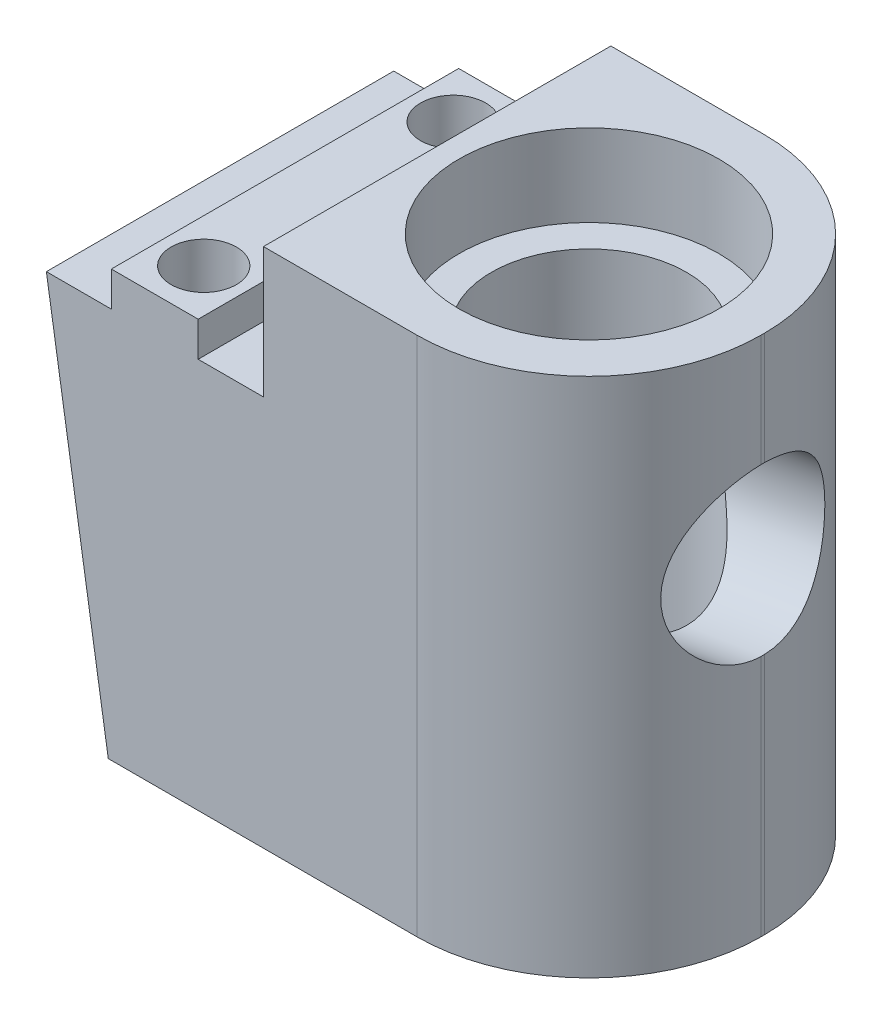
ISO-10303-21;
HEADER;
FILE_DESCRIPTION(('STEP AP214'),'2;1');
FILE_NAME('part.step','',(''),(''),'','','');
FILE_SCHEMA(('AUTOMOTIVE_DESIGN { 1 0 10303 214 1 1 1 1 }'));
ENDSEC;
DATA;
#1=APPLICATION_CONTEXT('core data for automotive mechanical design processes');
#2=APPLICATION_PROTOCOL_DEFINITION('international standard','automotive_design',2000,#1);
#3=PRODUCT_CONTEXT('',#1,'mechanical');
#4=PRODUCT('Part','Part','',(#3));
#5=PRODUCT_RELATED_PRODUCT_CATEGORY('part','',(#4));
#6=PRODUCT_DEFINITION_FORMATION('','',#4);
#7=PRODUCT_DEFINITION_CONTEXT('part definition',#1,'design');
#8=PRODUCT_DEFINITION('design','',#6,#7);
#9=PRODUCT_DEFINITION_SHAPE('','',#8);
#10=(LENGTH_UNIT() NAMED_UNIT(*) SI_UNIT(.MILLI.,.METRE.));
#11=(NAMED_UNIT(*) PLANE_ANGLE_UNIT() SI_UNIT($,.RADIAN.));
#12=(NAMED_UNIT(*) SI_UNIT($,.STERADIAN.) SOLID_ANGLE_UNIT());
#13=UNCERTAINTY_MEASURE_WITH_UNIT(LENGTH_MEASURE(1.E-05),#10,'distance_accuracy_value','');
#14=(GEOMETRIC_REPRESENTATION_CONTEXT(3) GLOBAL_UNCERTAINTY_ASSIGNED_CONTEXT((#13)) GLOBAL_UNIT_ASSIGNED_CONTEXT((#10,
#11,#12)) REPRESENTATION_CONTEXT('',''));
#15=CARTESIAN_POINT('',(0.,0.,0.));
#16=DIRECTION('',(0.,0.,1.));
#17=DIRECTION('',(1.,0.,0.));
#18=AXIS2_PLACEMENT_3D('',#15,#16,#17);
#19=CARTESIAN_POINT('',(30.1752,19.05,12.7));
#20=DIRECTION('',(-1.,0.,0.));
#21=DIRECTION('',(0.,-1.,0.));
#22=AXIS2_PLACEMENT_3D('',#19,#20,#21);
#23=PLANE('',#22);
#24=DIRECTION('',(0.,1.,0.));
#25=VECTOR('',#24,1.);
#26=CARTESIAN_POINT('',(30.1752,-19.05,0.127));
#27=LINE('',#26,#25);
#28=CARTESIAN_POINT('',(30.1752,19.05,0.127));
#29=VERTEX_POINT('',#28);
#30=CARTESIAN_POINT('',(30.1752,10.8527119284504,0.127));
#31=VERTEX_POINT('',#30);
#32=EDGE_CURVE('E157',#29,#31,#27,.F.);
#33=ORIENTED_EDGE('',*,*,#32,.T.);
#34=CARTESIAN_POINT('',(30.1752,4.77928216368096,0.));
#35=DIRECTION('',(-1.,0.,0.));
#36=DIRECTION('',(0.,-1.,0.));
#37=AXIS2_PLACEMENT_3D('',#34,#35,#36);
#38=ELLIPSE('',#37,6.07479075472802,6.);
#39=CARTESIAN_POINT('',(30.1752,10.8527119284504,-0.127));
#40=VERTEX_POINT('',#39);
#41=EDGE_CURVE('E54',#31,#40,#38,.T.);
#42=ORIENTED_EDGE('',*,*,#41,.T.);
#43=DIRECTION('',(0.,1.,0.));
#44=VECTOR('',#43,1.);
#45=CARTESIAN_POINT('',(30.1752,19.05,-0.127));
#46=LINE('',#45,#44);
#47=CARTESIAN_POINT('',(30.1752,19.05,-0.127));
#48=VERTEX_POINT('',#47);
#49=EDGE_CURVE('E160',#40,#48,#46,.T.);
#50=ORIENTED_EDGE('',*,*,#49,.T.);
#51=DIRECTION('',(0.,0.,-1.));
#52=VECTOR('',#51,1.);
#53=CARTESIAN_POINT('',(30.1752,19.05,12.7));
#54=LINE('',#53,#52);
#55=EDGE_CURVE('E161',#29,#48,#54,.T.);
#56=ORIENTED_EDGE('',*,*,#55,.F.);
#57=EDGE_LOOP('',(#33,#42,#50,#56));
#58=FACE_BOUND('',#57,.T.);
#59=ADVANCED_FACE('F35',(#58),#23,.F.);
#60=CARTESIAN_POINT('',(30.1752,-19.05,-0.127));
#61=VERTEX_POINT('',#60);
#62=CARTESIAN_POINT('',(30.1752,-1.2941476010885,-0.127));
#63=VERTEX_POINT('',#62);
#64=EDGE_CURVE('E153',#61,#63,#46,.T.);
#65=ORIENTED_EDGE('',*,*,#64,.T.);
#66=CARTESIAN_POINT('',(30.1752,-1.2941476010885,0.127));
#67=VERTEX_POINT('',#66);
#68=EDGE_CURVE('E141',#63,#67,#38,.T.);
#69=ORIENTED_EDGE('',*,*,#68,.T.);
#70=CARTESIAN_POINT('',(30.1752,-19.05,0.127));
#71=VERTEX_POINT('',#70);
#72=EDGE_CURVE('E151',#67,#71,#27,.F.);
#73=ORIENTED_EDGE('',*,*,#72,.T.);
#74=DIRECTION('',(0.,0.,-1.));
#75=VECTOR('',#74,1.);
#76=CARTESIAN_POINT('',(30.1752,-19.05,12.7));
#77=LINE('',#76,#75);
#78=EDGE_CURVE('E158',#71,#61,#77,.T.);
#79=ORIENTED_EDGE('',*,*,#78,.T.);
#80=EDGE_LOOP('',(#65,#69,#73,#79));
#81=FACE_BOUND('',#80,.T.);
#82=ADVANCED_FACE('F149',(#81),#23,.F.);
#83=CARTESIAN_POINT('',(6.37539999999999,19.05,12.7));
#84=DIRECTION('',(0.,-1.,0.));
#85=DIRECTION('',(0.,0.,-1.));
#86=AXIS2_PLACEMENT_3D('',#83,#84,#85);
#87=PLANE('',#86);
#88=CARTESIAN_POINT('',(17.4752,19.05,0.));
#89=DIRECTION('',(0.,1.,0.));
#90=DIRECTION('',(0.,0.,1.));
#91=AXIS2_PLACEMENT_3D('',#88,#89,#90);
#92=CIRCLE('',#91,9.4996);
#93=CARTESIAN_POINT('',(17.4752,19.05,9.4996));
#94=VERTEX_POINT('',#93);
#95=EDGE_CURVE('E347',#94,#94,#92,.T.);
#96=ORIENTED_EDGE('',*,*,#95,.F.);
#97=EDGE_LOOP('',(#96));
#98=FACE_BOUND('',#97,.T.);
#99=ORIENTED_EDGE('',*,*,#55,.T.);
#100=CARTESIAN_POINT('',(17.6022,19.05,-0.127));
#101=DIRECTION('',(0.,-1.,0.));
#102=DIRECTION('',(0.,0.,-1.));
#103=AXIS2_PLACEMENT_3D('',#100,#101,#102);
#104=CIRCLE('',#103,12.573);
#105=CARTESIAN_POINT('',(17.6022,19.05,-12.7));
#106=VERTEX_POINT('',#105);
#107=EDGE_CURVE('E169',#48,#106,#104,.F.);
#108=ORIENTED_EDGE('',*,*,#107,.T.);
#109=DIRECTION('',(-1.,0.,0.));
#110=VECTOR('',#109,1.);
#111=CARTESIAN_POINT('',(6.37539999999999,19.05,-12.7));
#112=LINE('',#111,#110);
#113=CARTESIAN_POINT('',(6.37539999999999,19.05,-12.7));
#114=VERTEX_POINT('',#113);
#115=EDGE_CURVE('E210',#106,#114,#112,.T.);
#116=ORIENTED_EDGE('',*,*,#115,.T.);
#117=DIRECTION('',(0.,0.,-1.));
#118=VECTOR('',#117,1.);
#119=CARTESIAN_POINT('',(6.37539999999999,19.05,12.7));
#120=LINE('',#119,#118);
#121=CARTESIAN_POINT('',(6.37539999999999,19.05,12.7));
#122=VERTEX_POINT('',#121);
#123=EDGE_CURVE('E188',#122,#114,#120,.T.);
#124=ORIENTED_EDGE('',*,*,#123,.F.);
#125=DIRECTION('',(-1.,0.,0.));
#126=VECTOR('',#125,1.);
#127=CARTESIAN_POINT('',(6.37539999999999,19.05,12.7));
#128=LINE('',#127,#126);
#129=CARTESIAN_POINT('',(17.6022,19.05,12.7));
#130=VERTEX_POINT('',#129);
#131=EDGE_CURVE('E179',#130,#122,#128,.T.);
#132=ORIENTED_EDGE('',*,*,#131,.F.);
#133=CARTESIAN_POINT('',(17.6022,19.05,0.127));
#134=DIRECTION('',(0.,-1.,0.));
#135=DIRECTION('',(0.,0.,-1.));
#136=AXIS2_PLACEMENT_3D('',#133,#134,#135);
#137=CIRCLE('',#136,12.573);
#138=EDGE_CURVE('E167',#130,#29,#137,.F.);
#139=ORIENTED_EDGE('',*,*,#138,.T.);
#140=EDGE_LOOP('',(#99,#108,#116,#124,#132,#139));
#141=FACE_BOUND('',#140,.T.);
#142=ADVANCED_FACE('F185',(#98,#141),#87,.F.);
#143=CARTESIAN_POINT('',(6.37539999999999,19.05,12.7));
#144=DIRECTION('',(1.,0.,0.));
#145=DIRECTION('',(0.,1.,0.));
#146=AXIS2_PLACEMENT_3D('',#143,#144,#145);
#147=PLANE('',#146);
#148=DIRECTION('',(0.,-1.,0.));
#149=VECTOR('',#148,1.);
#150=CARTESIAN_POINT('',(6.37539999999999,19.05,-12.7));
#151=LINE('',#150,#149);
#152=CARTESIAN_POINT('',(6.37539999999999,9.525,-12.7));
#153=VERTEX_POINT('',#152);
#154=EDGE_CURVE('E212',#114,#153,#151,.T.);
#155=ORIENTED_EDGE('',*,*,#154,.T.);
#156=DIRECTION('',(0.,0.,-1.));
#157=VECTOR('',#156,1.);
#158=CARTESIAN_POINT('',(6.37539999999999,9.525,12.7));
#159=LINE('',#158,#157);
#160=CARTESIAN_POINT('',(6.37539999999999,9.525,12.7));
#161=VERTEX_POINT('',#160);
#162=EDGE_CURVE('E246',#161,#153,#159,.T.);
#163=ORIENTED_EDGE('',*,*,#162,.F.);
#164=DIRECTION('',(0.,-1.,0.));
#165=VECTOR('',#164,1.);
#166=CARTESIAN_POINT('',(6.37539999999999,19.05,12.7));
#167=LINE('',#166,#165);
#168=EDGE_CURVE('E190',#122,#161,#167,.T.);
#169=ORIENTED_EDGE('',*,*,#168,.F.);
#170=ORIENTED_EDGE('',*,*,#123,.T.);
#171=EDGE_LOOP('',(#155,#163,#169,#170));
#172=FACE_BOUND('',#171,.T.);
#173=ADVANCED_FACE('F295',(#172),#147,.F.);
#174=CARTESIAN_POINT('',(6.37539999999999,9.525,12.7));
#175=DIRECTION('',(0.,-1.,0.));
#176=DIRECTION('',(1.,0.,0.));
#177=AXIS2_PLACEMENT_3D('',#174,#175,#176);
#178=PLANE('',#177);
#179=DIRECTION('',(-1.,0.,0.));
#180=VECTOR('',#179,1.);
#181=CARTESIAN_POINT('',(6.37539999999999,9.525,-12.7));
#182=LINE('',#181,#180);
#183=CARTESIAN_POINT('',(1.60019999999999,9.525,-12.7));
#184=VERTEX_POINT('',#183);
#185=EDGE_CURVE('E215',#153,#184,#182,.T.);
#186=ORIENTED_EDGE('',*,*,#185,.T.);
#187=DIRECTION('',(0.,0.,-1.));
#188=VECTOR('',#187,1.);
#189=CARTESIAN_POINT('',(1.60019999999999,9.525,12.7));
#190=LINE('',#189,#188);
#191=CARTESIAN_POINT('',(1.60019999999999,9.525,12.7));
#192=VERTEX_POINT('',#191);
#193=EDGE_CURVE('E243',#192,#184,#190,.T.);
#194=ORIENTED_EDGE('',*,*,#193,.F.);
#195=DIRECTION('',(-1.,0.,0.));
#196=VECTOR('',#195,1.);
#197=CARTESIAN_POINT('',(6.37539999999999,9.525,12.7));
#198=LINE('',#197,#196);
#199=EDGE_CURVE('E192',#161,#192,#198,.T.);
#200=ORIENTED_EDGE('',*,*,#199,.F.);
#201=ORIENTED_EDGE('',*,*,#162,.T.);
#202=EDGE_LOOP('',(#186,#194,#200,#201));
#203=FACE_BOUND('',#202,.T.);
#204=ADVANCED_FACE('F292',(#203),#178,.F.);
#205=CARTESIAN_POINT('',(1.60019999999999,12.065,12.7));
#206=DIRECTION('',(-1.,0.,0.));
#207=DIRECTION('',(0.,-1.,0.));
#208=AXIS2_PLACEMENT_3D('',#205,#206,#207);
#209=PLANE('',#208);
#210=DIRECTION('',(0.,1.,0.));
#211=VECTOR('',#210,1.);
#212=CARTESIAN_POINT('',(1.60019999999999,12.065,-12.7));
#213=LINE('',#212,#211);
#214=CARTESIAN_POINT('',(1.60019999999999,12.065,-12.7));
#215=VERTEX_POINT('',#214);
#216=EDGE_CURVE('E217',#184,#215,#213,.T.);
#217=ORIENTED_EDGE('',*,*,#216,.T.);
#218=DIRECTION('',(0.,0.,-1.));
#219=VECTOR('',#218,1.);
#220=CARTESIAN_POINT('',(1.60019999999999,12.065,12.7));
#221=LINE('',#220,#219);
#222=CARTESIAN_POINT('',(1.60019999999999,12.065,12.7));
#223=VERTEX_POINT('',#222);
#224=EDGE_CURVE('E240',#223,#215,#221,.T.);
#225=ORIENTED_EDGE('',*,*,#224,.F.);
#226=DIRECTION('',(0.,1.,0.));
#227=VECTOR('',#226,1.);
#228=CARTESIAN_POINT('',(1.60019999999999,12.065,12.7));
#229=LINE('',#228,#227);
#230=EDGE_CURVE('E199',#192,#223,#229,.T.);
#231=ORIENTED_EDGE('',*,*,#230,.F.);
#232=ORIENTED_EDGE('',*,*,#193,.T.);
#233=EDGE_LOOP('',(#217,#225,#231,#232));
#234=FACE_BOUND('',#233,.T.);
#235=ADVANCED_FACE('F287',(#234),#209,.F.);
#236=CARTESIAN_POINT('',(1.60019999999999,12.065,12.7));
#237=DIRECTION('',(0.,-1.,0.));
#238=DIRECTION('',(0.,0.,-1.));
#239=AXIS2_PLACEMENT_3D('',#236,#237,#238);
#240=PLANE('',#239);
#241=CARTESIAN_POINT('',(-1.57480000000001,12.065,9.1186));
#242=DIRECTION('',(0.,1.,0.));
#243=DIRECTION('',(-1.,0.,0.));
#244=AXIS2_PLACEMENT_3D('',#241,#242,#243);
#245=CIRCLE('',#244,2.3876);
#246=CARTESIAN_POINT('',(-3.96240000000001,12.065,9.1186));
#247=VERTEX_POINT('',#246);
#248=EDGE_CURVE('E564',#247,#247,#245,.T.);
#249=ORIENTED_EDGE('',*,*,#248,.F.);
#250=EDGE_LOOP('',(#249));
#251=FACE_BOUND('',#250,.T.);
#252=CARTESIAN_POINT('',(-1.57480000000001,12.065,-9.1186));
#253=DIRECTION('',(0.,1.,0.));
#254=DIRECTION('',(-1.,0.,0.));
#255=AXIS2_PLACEMENT_3D('',#252,#253,#254);
#256=CIRCLE('',#255,2.3876);
#257=CARTESIAN_POINT('',(-3.96240000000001,12.065,-9.1186));
#258=VERTEX_POINT('',#257);
#259=EDGE_CURVE('E569',#258,#258,#256,.T.);
#260=ORIENTED_EDGE('',*,*,#259,.F.);
#261=EDGE_LOOP('',(#260));
#262=FACE_BOUND('',#261,.T.);
#263=DIRECTION('',(-1.,0.,0.));
#264=VECTOR('',#263,1.);
#265=CARTESIAN_POINT('',(1.60019999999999,12.065,-12.7));
#266=LINE('',#265,#264);
#267=CARTESIAN_POINT('',(-4.74980000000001,12.065,-12.7));
#268=VERTEX_POINT('',#267);
#269=EDGE_CURVE('E219',#215,#268,#266,.T.);
#270=ORIENTED_EDGE('',*,*,#269,.T.);
#271=DIRECTION('',(0.,0.,-1.));
#272=VECTOR('',#271,1.);
#273=CARTESIAN_POINT('',(-4.74980000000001,12.065,12.7));
#274=LINE('',#273,#272);
#275=CARTESIAN_POINT('',(-4.74980000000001,12.065,12.7));
#276=VERTEX_POINT('',#275);
#277=EDGE_CURVE('E237',#276,#268,#274,.T.);
#278=ORIENTED_EDGE('',*,*,#277,.F.);
#279=DIRECTION('',(-1.,0.,0.));
#280=VECTOR('',#279,1.);
#281=CARTESIAN_POINT('',(1.60019999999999,12.065,12.7));
#282=LINE('',#281,#280);
#283=EDGE_CURVE('E201',#223,#276,#282,.T.);
#284=ORIENTED_EDGE('',*,*,#283,.F.);
#285=ORIENTED_EDGE('',*,*,#224,.T.);
#286=EDGE_LOOP('',(#270,#278,#284,#285));
#287=FACE_BOUND('',#286,.T.);
#288=ADVANCED_FACE('F282',(#251,#262,#287),#240,.F.);
#289=CARTESIAN_POINT('',(-4.74980000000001,12.065,12.7));
#290=DIRECTION('',(1.,0.,0.));
#291=DIRECTION('',(0.,0.,-1.));
#292=AXIS2_PLACEMENT_3D('',#289,#290,#291);
#293=PLANE('',#292);
#294=DIRECTION('',(0.,-1.,0.));
#295=VECTOR('',#294,1.);
#296=CARTESIAN_POINT('',(-4.74980000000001,12.065,-12.7));
#297=LINE('',#296,#295);
#298=CARTESIAN_POINT('',(-4.74980000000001,9.525,-12.7));
#299=VERTEX_POINT('',#298);
#300=EDGE_CURVE('E221',#268,#299,#297,.T.);
#301=ORIENTED_EDGE('',*,*,#300,.T.);
#302=DIRECTION('',(0.,0.,-1.));
#303=VECTOR('',#302,1.);
#304=CARTESIAN_POINT('',(-4.74980000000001,9.525,12.7));
#305=LINE('',#304,#303);
#306=CARTESIAN_POINT('',(-4.74980000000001,9.525,12.7));
#307=VERTEX_POINT('',#306);
#308=EDGE_CURVE('E234',#307,#299,#305,.T.);
#309=ORIENTED_EDGE('',*,*,#308,.F.);
#310=DIRECTION('',(0.,-1.,0.));
#311=VECTOR('',#310,1.);
#312=CARTESIAN_POINT('',(-4.74980000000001,12.065,12.7));
#313=LINE('',#312,#311);
#314=EDGE_CURVE('E203',#276,#307,#313,.T.);
#315=ORIENTED_EDGE('',*,*,#314,.F.);
#316=ORIENTED_EDGE('',*,*,#277,.T.);
#317=EDGE_LOOP('',(#301,#309,#315,#316));
#318=FACE_BOUND('',#317,.T.);
#319=ADVANCED_FACE('F278',(#318),#293,.F.);
#320=CARTESIAN_POINT('',(-4.74980000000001,9.525,12.7));
#321=DIRECTION('',(0.,-1.,0.));
#322=DIRECTION('',(1.,0.,0.));
#323=AXIS2_PLACEMENT_3D('',#320,#321,#322);
#324=PLANE('',#323);
#325=DIRECTION('',(-1.,0.,0.));
#326=VECTOR('',#325,1.);
#327=CARTESIAN_POINT('',(-4.74980000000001,9.525,-12.7));
#328=LINE('',#327,#326);
#329=CARTESIAN_POINT('',(-9.49960000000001,9.525,-12.7));
#330=VERTEX_POINT('',#329);
#331=EDGE_CURVE('E223',#299,#330,#328,.T.);
#332=ORIENTED_EDGE('',*,*,#331,.T.);
#333=DIRECTION('',(0.,0.,-1.));
#334=VECTOR('',#333,1.);
#335=CARTESIAN_POINT('',(-9.49960000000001,9.525,12.7));
#336=LINE('',#335,#334);
#337=CARTESIAN_POINT('',(-9.49960000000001,9.525,12.7));
#338=VERTEX_POINT('',#337);
#339=EDGE_CURVE('E231',#338,#330,#336,.T.);
#340=ORIENTED_EDGE('',*,*,#339,.F.);
#341=DIRECTION('',(-1.,0.,0.));
#342=VECTOR('',#341,1.);
#343=CARTESIAN_POINT('',(-4.74980000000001,9.525,12.7));
#344=LINE('',#343,#342);
#345=EDGE_CURVE('E205',#307,#338,#344,.T.);
#346=ORIENTED_EDGE('',*,*,#345,.F.);
#347=ORIENTED_EDGE('',*,*,#308,.T.);
#348=EDGE_LOOP('',(#332,#340,#346,#347));
#349=FACE_BOUND('',#348,.T.);
#350=ADVANCED_FACE('F273',(#349),#324,.F.);
#351=CARTESIAN_POINT('',(-4.97376461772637,-19.05,12.7));
#352=DIRECTION('',(0.987688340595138,0.156434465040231,0.));
#353=DIRECTION('',(-0.156434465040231,0.987688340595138,0.));
#354=AXIS2_PLACEMENT_3D('',#351,#352,#353);
#355=PLANE('',#354);
#356=CARTESIAN_POINT('',(-5.68554060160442,-14.5560233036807,8.7376));
#357=DIRECTION('',(-0.987688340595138,-0.156434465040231,0.));
#358=DIRECTION('',(0.156434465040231,-0.987688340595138,0.));
#359=AXIS2_PLACEMENT_3D('',#356,#357,#358);
#360=CIRCLE('',#359,2.3876);
#361=CARTESIAN_POINT('',(-5.31203767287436,-16.9142279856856,8.7376));
#362=VERTEX_POINT('',#361);
#363=EDGE_CURVE('E555',#362,#362,#360,.T.);
#364=ORIENTED_EDGE('',*,*,#363,.F.);
#365=EDGE_LOOP('',(#364));
#366=FACE_BOUND('',#365,.T.);
#367=CARTESIAN_POINT('',(-5.68554060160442,-14.5560233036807,-8.7376));
#368=DIRECTION('',(-0.987688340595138,-0.156434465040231,0.));
#369=DIRECTION('',(0.156434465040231,-0.987688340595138,0.));
#370=AXIS2_PLACEMENT_3D('',#367,#368,#369);
#371=CIRCLE('',#370,2.3876);
#372=CARTESIAN_POINT('',(-5.31203767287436,-16.9142279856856,-8.7376));
#373=VERTEX_POINT('',#372);
#374=EDGE_CURVE('E554',#373,#373,#371,.T.);
#375=ORIENTED_EDGE('',*,*,#374,.F.);
#376=EDGE_LOOP('',(#375));
#377=FACE_BOUND('',#376,.T.);
#378=CARTESIAN_POINT('',(-7.79543480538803,-1.2346755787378,0.));
#379=DIRECTION('',(-0.987688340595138,-0.156434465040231,0.));
#380=DIRECTION('',(0.156434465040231,-0.987688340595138,0.));
#381=AXIS2_PLACEMENT_3D('',#378,#379,#380);
#382=CIRCLE('',#381,6.);
#383=CARTESIAN_POINT('',(-6.85682801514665,-7.16080562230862,0.));
#384=VERTEX_POINT('',#383);
#385=EDGE_CURVE('E154',#384,#384,#382,.T.);
#386=ORIENTED_EDGE('',*,*,#385,.F.);
#387=EDGE_LOOP('',(#386));
#388=FACE_BOUND('',#387,.T.);
#389=DIRECTION('',(0.156434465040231,-0.987688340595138,0.));
#390=VECTOR('',#389,1.);
#391=CARTESIAN_POINT('',(-4.97376461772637,-19.05,-12.7));
#392=LINE('',#391,#390);
#393=CARTESIAN_POINT('',(-4.97376461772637,-19.05,-12.7));
#394=VERTEX_POINT('',#393);
#395=EDGE_CURVE('E225',#330,#394,#392,.T.);
#396=ORIENTED_EDGE('',*,*,#395,.T.);
#397=DIRECTION('',(0.,0.,-1.));
#398=VECTOR('',#397,1.);
#399=CARTESIAN_POINT('',(-4.97376461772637,-19.05,12.7));
#400=LINE('',#399,#398);
#401=CARTESIAN_POINT('',(-4.97376461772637,-19.05,12.7));
#402=VERTEX_POINT('',#401);
#403=EDGE_CURVE('E209',#402,#394,#400,.T.);
#404=ORIENTED_EDGE('',*,*,#403,.F.);
#405=DIRECTION('',(0.156434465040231,-0.987688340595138,0.));
#406=VECTOR('',#405,1.);
#407=CARTESIAN_POINT('',(-4.97376461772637,-19.05,12.7));
#408=LINE('',#407,#406);
#409=EDGE_CURVE('E207',#338,#402,#408,.T.);
#410=ORIENTED_EDGE('',*,*,#409,.F.);
#411=ORIENTED_EDGE('',*,*,#339,.T.);
#412=EDGE_LOOP('',(#396,#404,#410,#411));
#413=FACE_BOUND('',#412,.T.);
#414=ADVANCED_FACE('F267',(#366,#377,#388,#413),#355,.F.);
#415=CARTESIAN_POINT('',(0.,-19.05,12.7));
#416=DIRECTION('',(0.,1.,0.));
#417=DIRECTION('',(0.,0.,1.));
#418=AXIS2_PLACEMENT_3D('',#415,#416,#417);
#419=PLANE('',#418);
#420=CARTESIAN_POINT('',(17.4752,-19.05,0.));
#421=DIRECTION('',(0.,-1.,0.));
#422=DIRECTION('',(1.,0.,0.));
#423=AXIS2_PLACEMENT_3D('',#420,#421,#422);
#424=CIRCLE('',#423,9.4996);
#425=CARTESIAN_POINT('',(26.9748,-19.05,0.));
#426=VERTEX_POINT('',#425);
#427=EDGE_CURVE('E348',#426,#426,#424,.T.);
#428=ORIENTED_EDGE('',*,*,#427,.F.);
#429=EDGE_LOOP('',(#428));
#430=FACE_BOUND('',#429,.T.);
#431=DIRECTION('',(1.,0.,0.));
#432=VECTOR('',#431,1.);
#433=CARTESIAN_POINT('',(0.,-19.05,-12.7));
#434=LINE('',#433,#432);
#435=CARTESIAN_POINT('',(17.6022,-19.05,-12.7));
#436=VERTEX_POINT('',#435);
#437=EDGE_CURVE('E194',#394,#436,#434,.T.);
#438=ORIENTED_EDGE('',*,*,#437,.T.);
#439=CARTESIAN_POINT('',(17.6022,-19.05,-0.127));
#440=DIRECTION('',(0.,1.,0.));
#441=DIRECTION('',(0.,0.,1.));
#442=AXIS2_PLACEMENT_3D('',#439,#440,#441);
#443=CIRCLE('',#442,12.573);
#444=EDGE_CURVE('E174',#436,#61,#443,.F.);
#445=ORIENTED_EDGE('',*,*,#444,.T.);
#446=ORIENTED_EDGE('',*,*,#78,.F.);
#447=CARTESIAN_POINT('',(17.6022,-19.05,0.127));
#448=DIRECTION('',(0.,1.,0.));
#449=DIRECTION('',(0.,0.,1.));
#450=AXIS2_PLACEMENT_3D('',#447,#448,#449);
#451=CIRCLE('',#450,12.573);
#452=CARTESIAN_POINT('',(17.6022,-19.05,12.7));
#453=VERTEX_POINT('',#452);
#454=EDGE_CURVE('E62',#71,#453,#451,.F.);
#455=ORIENTED_EDGE('',*,*,#454,.T.);
#456=DIRECTION('',(1.,0.,0.));
#457=VECTOR('',#456,1.);
#458=CARTESIAN_POINT('',(30.1752,-19.05,12.7));
#459=LINE('',#458,#457);
#460=EDGE_CURVE('E182',#402,#453,#459,.T.);
#461=ORIENTED_EDGE('',*,*,#460,.F.);
#462=ORIENTED_EDGE('',*,*,#403,.T.);
#463=EDGE_LOOP('',(#438,#445,#446,#455,#461,#462));
#464=FACE_BOUND('',#463,.T.);
#465=ADVANCED_FACE('F263',(#430,#464),#419,.F.);
#466=CARTESIAN_POINT('',(0.,0.,12.7));
#467=DIRECTION('',(0.,0.,1.));
#468=DIRECTION('',(1.,0.,0.));
#469=AXIS2_PLACEMENT_3D('',#466,#467,#468);
#470=PLANE('',#469);
#471=ORIENTED_EDGE('',*,*,#460,.T.);
#472=DIRECTION('',(0.,1.,0.));
#473=VECTOR('',#472,1.);
#474=CARTESIAN_POINT('',(17.6022,19.05,12.7));
#475=LINE('',#474,#473);
#476=EDGE_CURVE('E48',#453,#130,#475,.T.);
#477=ORIENTED_EDGE('',*,*,#476,.T.);
#478=ORIENTED_EDGE('',*,*,#131,.T.);
#479=ORIENTED_EDGE('',*,*,#168,.T.);
#480=ORIENTED_EDGE('',*,*,#199,.T.);
#481=ORIENTED_EDGE('',*,*,#230,.T.);
#482=ORIENTED_EDGE('',*,*,#283,.T.);
#483=ORIENTED_EDGE('',*,*,#314,.T.);
#484=ORIENTED_EDGE('',*,*,#345,.T.);
#485=ORIENTED_EDGE('',*,*,#409,.T.);
#486=EDGE_LOOP('',(#471,#477,#478,#479,#480,#481,#482,#483,#484,#485));
#487=FACE_BOUND('',#486,.T.);
#488=ADVANCED_FACE('F178',(#487),#470,.T.);
#489=CARTESIAN_POINT('',(0.,0.,-12.7));
#490=DIRECTION('',(0.,0.,1.));
#491=DIRECTION('',(1.,0.,0.));
#492=AXIS2_PLACEMENT_3D('',#489,#490,#491);
#493=PLANE('',#492);
#494=ORIENTED_EDGE('',*,*,#115,.F.);
#495=DIRECTION('',(0.,1.,0.));
#496=VECTOR('',#495,1.);
#497=CARTESIAN_POINT('',(17.6022,0.,-12.7));
#498=LINE('',#497,#496);
#499=EDGE_CURVE('E171',#106,#436,#498,.F.);
#500=ORIENTED_EDGE('',*,*,#499,.T.);
#501=ORIENTED_EDGE('',*,*,#437,.F.);
#502=ORIENTED_EDGE('',*,*,#395,.F.);
#503=ORIENTED_EDGE('',*,*,#331,.F.);
#504=ORIENTED_EDGE('',*,*,#300,.F.);
#505=ORIENTED_EDGE('',*,*,#269,.F.);
#506=ORIENTED_EDGE('',*,*,#216,.F.);
#507=ORIENTED_EDGE('',*,*,#185,.F.);
#508=ORIENTED_EDGE('',*,*,#154,.F.);
#509=EDGE_LOOP('',(#494,#500,#501,#502,#503,#504,#505,#506,#507,#508));
#510=FACE_BOUND('',#509,.T.);
#511=ADVANCED_FACE('F260',(#510),#493,.F.);
#512=CARTESIAN_POINT('',(17.4752,13.0556,0.));
#513=DIRECTION('',(0.,1.,0.));
#514=DIRECTION('',(0.,0.,1.));
#515=AXIS2_PLACEMENT_3D('',#512,#513,#514);
#516=CYLINDRICAL_SURFACE('',#515,9.4996);
#517=CARTESIAN_POINT('',(17.4752,13.0556,0.));
#518=DIRECTION('',(0.,1.,0.));
#519=DIRECTION('',(0.,0.,1.));
#520=AXIS2_PLACEMENT_3D('',#517,#518,#519);
#521=CIRCLE('',#520,9.4996);
#522=CARTESIAN_POINT('',(17.4752,13.0556,9.4996));
#523=VERTEX_POINT('',#522);
#524=EDGE_CURVE('E213',#523,#523,#521,.T.);
#525=ORIENTED_EDGE('',*,*,#524,.F.);
#526=EDGE_LOOP('',(#525));
#527=FACE_BOUND('',#526,.T.);
#528=ORIENTED_EDGE('',*,*,#95,.T.);
#529=EDGE_LOOP('',(#528));
#530=FACE_BOUND('',#529,.T.);
#531=ADVANCED_FACE('F355',(#527,#530),#516,.F.);
#532=CARTESIAN_POINT('',(17.4752,13.0556,0.));
#533=DIRECTION('',(0.,1.,0.));
#534=DIRECTION('',(0.,0.,1.));
#535=AXIS2_PLACEMENT_3D('',#532,#533,#534);
#536=PLANE('',#535);
#537=CARTESIAN_POINT('',(17.4752,13.0556,0.));
#538=DIRECTION('',(0.,1.,0.));
#539=DIRECTION('',(0.,0.,1.));
#540=AXIS2_PLACEMENT_3D('',#537,#538,#539);
#541=CIRCLE('',#540,7.1374);
#542=CARTESIAN_POINT('',(17.4752,13.0556,7.1374));
#543=VERTEX_POINT('',#542);
#544=EDGE_CURVE('E341',#543,#543,#541,.T.);
#545=ORIENTED_EDGE('',*,*,#544,.F.);
#546=EDGE_LOOP('',(#545));
#547=FACE_BOUND('',#546,.T.);
#548=ORIENTED_EDGE('',*,*,#524,.T.);
#549=EDGE_LOOP('',(#548));
#550=FACE_BOUND('',#549,.T.);
#551=ADVANCED_FACE('F357',(#547,#550),#536,.T.);
#552=CARTESIAN_POINT('',(17.4752,-13.0556,0.));
#553=DIRECTION('',(0.,-1.,0.));
#554=DIRECTION('',(1.,0.,0.));
#555=AXIS2_PLACEMENT_3D('',#552,#553,#554);
#556=CYLINDRICAL_SURFACE('',#555,9.4996);
#557=CARTESIAN_POINT('',(17.4752,-13.0556,0.));
#558=DIRECTION('',(0.,-1.,0.));
#559=DIRECTION('',(1.,0.,0.));
#560=AXIS2_PLACEMENT_3D('',#557,#558,#559);
#561=CIRCLE('',#560,9.4996);
#562=CARTESIAN_POINT('',(26.9748,-13.0556,0.));
#563=VERTEX_POINT('',#562);
#564=EDGE_CURVE('E344',#563,#563,#561,.T.);
#565=ORIENTED_EDGE('',*,*,#564,.F.);
#566=EDGE_LOOP('',(#565));
#567=FACE_BOUND('',#566,.T.);
#568=ORIENTED_EDGE('',*,*,#427,.T.);
#569=EDGE_LOOP('',(#568));
#570=FACE_BOUND('',#569,.T.);
#571=ADVANCED_FACE('F364',(#567,#570),#556,.F.);
#572=CARTESIAN_POINT('',(17.4752,-13.0556,0.));
#573=DIRECTION('',(0.,-1.,0.));
#574=DIRECTION('',(1.,0.,0.));
#575=AXIS2_PLACEMENT_3D('',#572,#573,#574);
#576=PLANE('',#575);
#577=CARTESIAN_POINT('',(17.4752,-13.0556,0.));
#578=DIRECTION('',(0.,-1.,0.));
#579=DIRECTION('',(1.,0.,0.));
#580=AXIS2_PLACEMENT_3D('',#577,#578,#579);
#581=CIRCLE('',#580,7.1374);
#582=CARTESIAN_POINT('',(24.6126,-13.0556,0.));
#583=VERTEX_POINT('',#582);
#584=EDGE_CURVE('E165',#583,#583,#581,.T.);
#585=ORIENTED_EDGE('',*,*,#584,.F.);
#586=EDGE_LOOP('',(#585));
#587=FACE_BOUND('',#586,.T.);
#588=ORIENTED_EDGE('',*,*,#564,.T.);
#589=EDGE_LOOP('',(#588));
#590=FACE_BOUND('',#589,.T.);
#591=ADVANCED_FACE('F447',(#587,#590),#576,.T.);
#592=CARTESIAN_POINT('',(17.4752,-20.5994,0.));
#593=DIRECTION('',(0.,1.,0.));
#594=DIRECTION('',(0.,0.,1.));
#595=AXIS2_PLACEMENT_3D('',#592,#593,#594);
#596=CYLINDRICAL_SURFACE('',#595,7.1374);
#597=CARTESIAN_POINT('',(24.6126,-2.17653787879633,0.));
#598=CARTESIAN_POINT('',(24.6126004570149,-2.17653826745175,-0.148847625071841));
#599=CARTESIAN_POINT('',(24.6079358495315,-2.17166138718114,-0.297689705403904));
#600=CARTESIAN_POINT('',(24.5893772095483,-2.15223068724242,-0.59415295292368));
#601=CARTESIAN_POINT('',(24.575483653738,-2.13767736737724,-0.741774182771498));
#602=CARTESIAN_POINT('',(24.5387485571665,-2.09910691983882,-1.03467512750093));
#603=CARTESIAN_POINT('',(24.5159049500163,-2.07508760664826,-1.17995429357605));
#604=CARTESIAN_POINT('',(24.4617221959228,-2.01792410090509,-1.46708436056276));
#605=CARTESIAN_POINT('',(24.4303828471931,-1.98477969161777,-1.60893517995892));
#606=CARTESIAN_POINT('',(24.3599567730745,-1.90996670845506,-1.88763268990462));
#607=CARTESIAN_POINT('',(24.3209074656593,-1.86833927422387,-2.02449990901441));
#608=CARTESIAN_POINT('',(24.2356420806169,-1.77693369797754,-2.2932089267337));
#609=CARTESIAN_POINT('',(24.1894232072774,-1.7271523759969,-2.42504873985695));
#610=CARTESIAN_POINT('',(24.041144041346,-1.5663534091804,-2.81192964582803));
#611=CARTESIAN_POINT('',(23.9293884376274,-1.4438045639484,-3.05861170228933));
#612=CARTESIAN_POINT('',(23.6765524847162,-1.160674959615,-3.54500014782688));
#613=CARTESIAN_POINT('',(23.5338207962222,-0.997802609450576,-3.78248378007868));
#614=CARTESIAN_POINT('',(23.2336223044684,-0.643511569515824,-4.22547520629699));
#615=CARTESIAN_POINT('',(23.0761275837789,-0.452038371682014,-4.43092037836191));
#616=CARTESIAN_POINT('',(22.8213706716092,-0.125836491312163,-4.73101125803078));
#617=CARTESIAN_POINT('',(22.7257263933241,0.000206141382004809,-4.8366842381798));
#618=CARTESIAN_POINT('',(22.5348952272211,0.26199762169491,-5.0359671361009));
#619=CARTESIAN_POINT('',(22.4397085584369,0.397750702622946,-5.12957174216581));
#620=CARTESIAN_POINT('',(22.2528604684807,0.679069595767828,-5.3040305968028));
#621=CARTESIAN_POINT('',(22.1611926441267,0.824616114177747,-5.38490892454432));
#622=CARTESIAN_POINT('',(21.9849529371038,1.12624220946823,-5.53334085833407));
#623=CARTESIAN_POINT('',(21.900374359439,1.28231159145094,-5.6009071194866));
#624=CARTESIAN_POINT('',(21.7354299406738,1.62148578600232,-5.72754187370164));
#625=CARTESIAN_POINT('',(21.6562548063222,1.80574667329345,-5.78516474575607));
#626=CARTESIAN_POINT('',(21.5543660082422,2.09152301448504,-5.85701535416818));
#627=CARTESIAN_POINT('',(21.5232348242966,2.188259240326,-5.87852276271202));
#628=CARTESIAN_POINT('',(21.4675846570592,2.38456879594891,-5.91645793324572));
#629=CARTESIAN_POINT('',(21.4430623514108,2.48414067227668,-5.93288824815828));
#630=CARTESIAN_POINT('',(21.4012984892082,2.68664215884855,-5.96060986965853));
#631=CARTESIAN_POINT('',(21.3841372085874,2.78959622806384,-5.97184461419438));
#632=CARTESIAN_POINT('',(21.358103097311,2.99699588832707,-5.98880502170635));
#633=CARTESIAN_POINT('',(21.3492297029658,3.10144137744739,-5.99453105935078));
#634=CARTESIAN_POINT('',(21.3399497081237,3.31090238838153,-6.00051826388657));
#635=CARTESIAN_POINT('',(21.339546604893,3.4159181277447,-6.00077717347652));
#636=CARTESIAN_POINT('',(21.3469207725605,3.62557944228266,-5.99602142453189));
#637=CARTESIAN_POINT('',(21.3547025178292,3.73022478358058,-5.99100388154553));
#638=CARTESIAN_POINT('',(21.379727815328,3.95590870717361,-5.97473021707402));
#639=CARTESIAN_POINT('',(21.3983487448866,4.07672734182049,-5.96256269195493));
#640=CARTESIAN_POINT('',(21.4444042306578,4.31591995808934,-5.93200243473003));
#641=CARTESIAN_POINT('',(21.4718458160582,4.43429190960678,-5.91360473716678));
#642=CARTESIAN_POINT('',(21.5340524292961,4.66837465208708,-5.87108291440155));
#643=CARTESIAN_POINT('',(21.5688375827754,4.78407714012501,-5.8469430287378));
#644=CARTESIAN_POINT('',(21.6442133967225,5.01227351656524,-5.79343986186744));
#645=CARTESIAN_POINT('',(21.6848028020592,5.12476809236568,-5.76407770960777));
#646=CARTESIAN_POINT('',(21.8010799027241,5.42569667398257,-5.67781322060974));
#647=CARTESIAN_POINT('',(21.8811597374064,5.61109213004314,-5.61620062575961));
#648=CARTESIAN_POINT('',(22.0496624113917,5.97307518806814,-5.4798316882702));
#649=CARTESIAN_POINT('',(22.1380911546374,6.14965642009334,-5.40506601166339));
#650=CARTESIAN_POINT('',(22.319889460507,6.49468814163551,-5.24274249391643));
#651=CARTESIAN_POINT('',(22.4132684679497,6.66312182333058,-5.15515959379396));
#652=CARTESIAN_POINT('',(22.6020675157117,6.99155167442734,-4.96743783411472));
#653=CARTESIAN_POINT('',(22.6974870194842,7.15155002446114,-4.86730224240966));
#654=CARTESIAN_POINT('',(22.8946055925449,7.47339357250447,-4.64712816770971));
#655=CARTESIAN_POINT('',(22.9962959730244,7.6346410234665,-4.52620462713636));
#656=CARTESIAN_POINT('',(23.1971797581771,7.94658023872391,-4.26942855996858));
#657=CARTESIAN_POINT('',(23.296372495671,8.09726920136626,-4.13357209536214));
#658=CARTESIAN_POINT('',(23.4896118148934,8.38625915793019,-3.84695793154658));
#659=CARTESIAN_POINT('',(23.5836743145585,8.52459943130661,-3.69625094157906));
#660=CARTESIAN_POINT('',(23.7645464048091,8.78749561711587,-3.37933782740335));
#661=CARTESIAN_POINT('',(23.851358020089,8.91205538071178,-3.21313605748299));
#662=CARTESIAN_POINT('',(24.0364551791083,9.17531406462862,-2.81974709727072));
#663=CARTESIAN_POINT('',(24.1318754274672,9.30929892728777,-2.58792389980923));
#664=CARTESIAN_POINT('',(24.2587821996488,9.48622984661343,-2.22308978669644));
#665=CARTESIAN_POINT('',(24.2983877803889,9.54120898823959,-2.09859786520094));
#666=CARTESIAN_POINT('',(24.3714545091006,9.64233176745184,-1.84434752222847));
#667=CARTESIAN_POINT('',(24.4049182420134,9.68847912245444,-1.71459134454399));
#668=CARTESIAN_POINT('',(24.4652776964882,9.77152850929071,-1.44914030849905));
#669=CARTESIAN_POINT('',(24.4921035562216,9.80833229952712,-1.31339865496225));
#670=CARTESIAN_POINT('',(24.5380696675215,9.8712973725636,-1.03817550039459));
#671=CARTESIAN_POINT('',(24.5572099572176,9.89745870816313,-0.898694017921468));
#672=CARTESIAN_POINT('',(24.587260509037,9.93849698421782,-0.61731345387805));
#673=CARTESIAN_POINT('',(24.5981774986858,9.95338314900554,-0.475416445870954));
#674=CARTESIAN_POINT('',(24.6114821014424,9.97152174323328,-0.190489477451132));
#675=CARTESIAN_POINT('',(24.6138709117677,9.97477580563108,-0.0474596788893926));
#676=CARTESIAN_POINT('',(24.6103159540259,9.9699307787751,0.21864347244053));
#677=CARTESIAN_POINT('',(24.6054704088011,9.9633280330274,0.341762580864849));
#678=CARTESIAN_POINT('',(24.5894921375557,9.94153619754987,0.586867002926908));
#679=CARTESIAN_POINT('',(24.578357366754,9.92634431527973,0.708851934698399));
#680=CARTESIAN_POINT('',(24.5500406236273,9.88765750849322,0.950752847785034));
#681=CARTESIAN_POINT('',(24.532860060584,9.86416451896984,1.07066930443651));
#682=CARTESIAN_POINT('',(24.4928063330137,9.80929126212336,1.30773163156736));
#683=CARTESIAN_POINT('',(24.4699308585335,9.77790779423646,1.42487635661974));
#684=CARTESIAN_POINT('',(24.3936114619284,9.67295747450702,1.77011216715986));
#685=CARTESIAN_POINT('',(24.3323226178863,9.58838474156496,1.99324642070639));
#686=CARTESIAN_POINT('',(24.1927656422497,9.39437825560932,2.42237967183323));
#687=CARTESIAN_POINT('',(24.1144932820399,9.28493831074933,2.62837438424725));
#688=CARTESIAN_POINT('',(23.8981614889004,8.97947485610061,3.13019553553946));
#689=CARTESIAN_POINT('',(23.7508614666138,8.76889091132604,3.41329875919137));
#690=CARTESIAN_POINT('',(23.5160260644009,8.42498019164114,3.8045063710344));
#691=CARTESIAN_POINT('',(23.435243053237,8.3053808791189,3.92956892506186));
#692=CARTESIAN_POINT('',(23.2704250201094,8.05775689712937,4.16880051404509));
#693=CARTESIAN_POINT('',(23.1863902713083,7.92973293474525,4.2829704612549));
#694=CARTESIAN_POINT('',(22.9939910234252,7.63117408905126,4.52945126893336));
#695=CARTESIAN_POINT('',(22.8850751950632,7.45835766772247,4.65856297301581));
#696=CARTESIAN_POINT('',(22.6671635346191,7.10142708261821,4.90025131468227));
#697=CARTESIAN_POINT('',(22.5581676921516,6.91730657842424,5.01281855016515));
#698=CARTESIAN_POINT('',(22.3436968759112,6.53847385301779,5.22135303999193));
#699=CARTESIAN_POINT('',(22.2382158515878,6.34378153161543,5.31735015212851));
#700=CARTESIAN_POINT('',(22.0349553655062,5.94334788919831,5.49263837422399));
#701=CARTESIAN_POINT('',(21.9371687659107,5.73761711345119,5.5719450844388));
#702=CARTESIAN_POINT('',(21.7573291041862,5.31909436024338,5.71125815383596));
#703=CARTESIAN_POINT('',(21.6749661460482,5.10657326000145,5.77166612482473));
#704=CARTESIAN_POINT('',(21.531605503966,4.67010960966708,5.87331324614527));
#705=CARTESIAN_POINT('',(21.4705639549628,4.44619160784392,5.91459180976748));
#706=CARTESIAN_POINT('',(21.3878985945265,4.02665227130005,5.96953695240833));
#707=CARTESIAN_POINT('',(21.3614189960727,3.83249079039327,5.986645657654));
#708=CARTESIAN_POINT('',(21.3365702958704,3.44170224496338,6.00271524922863));
#709=CARTESIAN_POINT('',(21.3381539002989,3.2450798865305,6.00170666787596));
#710=CARTESIAN_POINT('',(21.3711419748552,2.8550654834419,5.98034030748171));
#711=CARTESIAN_POINT('',(21.402603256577,2.66168030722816,5.9599456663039));
#712=CARTESIAN_POINT('',(21.4914996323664,2.28380888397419,5.90038734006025));
#713=CARTESIAN_POINT('',(21.5489852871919,2.09934073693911,5.86118711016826));
#714=CARTESIAN_POINT('',(21.6636328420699,1.79360837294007,5.77952715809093));
#715=CARTESIAN_POINT('',(21.7161588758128,1.66939092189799,5.74122686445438));
#716=CARTESIAN_POINT('',(21.8283822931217,1.42702009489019,5.65660857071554));
#717=CARTESIAN_POINT('',(21.8880830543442,1.3088696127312,5.61028678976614));
#718=CARTESIAN_POINT('',(22.0126488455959,1.07828217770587,5.51003127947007));
#719=CARTESIAN_POINT('',(22.0775266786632,0.96586059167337,5.45607840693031));
#720=CARTESIAN_POINT('',(22.2105463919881,0.746782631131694,5.34104049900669));
#721=CARTESIAN_POINT('',(22.2786882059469,0.640126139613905,5.27995560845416));
#722=CARTESIAN_POINT('',(22.4444680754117,0.390666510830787,5.12507045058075));
#723=CARTESIAN_POINT('',(22.5429901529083,0.250492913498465,5.02796522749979));
#724=CARTESIAN_POINT('',(22.7404879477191,-0.0195968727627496,4.82076118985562));
#725=CARTESIAN_POINT('',(22.8394638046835,-0.149509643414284,4.71065807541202));
#726=CARTESIAN_POINT('',(23.03534294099,-0.399183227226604,4.47777227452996));
#727=CARTESIAN_POINT('',(23.1322459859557,-0.518942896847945,4.35498816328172));
#728=CARTESIAN_POINT('',(23.3217671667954,-0.748050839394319,4.09704114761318));
#729=CARTESIAN_POINT('',(23.4143858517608,-0.857400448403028,3.96187983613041));
#730=CARTESIAN_POINT('',(23.593611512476,-1.06547982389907,3.67907959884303));
#731=CARTESIAN_POINT('',(23.6801997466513,-1.16417696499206,3.53140468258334));
#732=CARTESIAN_POINT('',(23.8451015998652,-1.34975027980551,3.22446470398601));
#733=CARTESIAN_POINT('',(23.9234167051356,-1.4366285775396,3.0652017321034));
#734=CARTESIAN_POINT('',(24.0697812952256,-1.59744249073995,2.73612013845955));
#735=CARTESIAN_POINT('',(24.1378468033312,-1.6713983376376,2.56631859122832));
#736=CARTESIAN_POINT('',(24.2620337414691,-1.8053873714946,2.21713080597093));
#737=CARTESIAN_POINT('',(24.3181590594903,-1.86542509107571,2.03774771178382));
#738=CARTESIAN_POINT('',(24.407150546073,-1.96015750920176,1.70700286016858));
#739=CARTESIAN_POINT('',(24.4424194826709,-1.99751315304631,1.55704296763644));
#740=CARTESIAN_POINT('',(24.5034534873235,-2.06197845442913,1.25305514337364));
#741=CARTESIAN_POINT('',(24.5292207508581,-2.08909047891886,1.09902816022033));
#742=CARTESIAN_POINT('',(24.5706731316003,-2.13263538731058,0.788228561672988));
#743=CARTESIAN_POINT('',(24.5863646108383,-2.14907501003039,0.631457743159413));
#744=CARTESIAN_POINT('',(24.607327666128,-2.17102590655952,0.316455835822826));
#745=CARTESIAN_POINT('',(24.6125995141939,-2.17653746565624,0.158224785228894));
#746=CARTESIAN_POINT('',(24.6126,-2.17653787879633,0.));
#747=B_SPLINE_CURVE_WITH_KNOTS('',3,(#597,#598,#599,#600,#601,#602,#603,#604,#605,#606,#607,
#608,#609,#610,#611,#612,#613,#614,#615,#616,#617,#618,#619,#620,#621,#622,#623,#624,#625,#626,
#627,#628,#629,#630,#631,#632,#633,#634,#635,#636,#637,#638,#639,#640,#641,#642,#643,#644,#645,
#646,#647,#648,#649,#650,#651,#652,#653,#654,#655,#656,#657,#658,#659,#660,#661,#662,#663,#664,
#665,#666,#667,#668,#669,#670,#671,#672,#673,#674,#675,#676,#677,#678,#679,#680,#681,#682,#683,
#684,#685,#686,#687,#688,#689,#690,#691,#692,#693,#694,#695,#696,#697,#698,#699,#700,#701,#702,
#703,#704,#705,#706,#707,#708,#709,#710,#711,#712,#713,#714,#715,#716,#717,#718,#719,#720,#721,
#722,#723,#724,#725,#726,#727,#728,#729,#730,#731,#732,#733,#734,#735,#736,#737,#738,#739,#740,
#741,#742,#743,#744,#745,#746),.UNSPECIFIED.,.T.,.F.,(4,2,2,2,2,2,2,2,2,2,2,2,2,2,2,2,2,2,2,2,2,
2,2,2,2,2,2,2,2,2,2,2,2,2,2,2,2,2,2,2,2,2,2,2,2,2,2,2,2,2,2,2,2,2,2,2,2,2,2,2,2,2,2,2,2,2,2,2,2,
2,2,2,2,2,4),(0.,0.446381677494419,0.892740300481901,1.33920203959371,1.78567438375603,
2.23003093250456,2.67456119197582,3.56273561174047,4.52359156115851,5.48630266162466,
6.05657215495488,6.62709179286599,7.19651863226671,7.76540150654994,8.38908624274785,
8.70039663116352,9.01155022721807,9.32601579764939,9.64045997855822,9.95503398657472,
10.2697800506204,10.6377452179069,11.0060043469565,11.3752861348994,11.7444881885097,
12.3769077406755,13.0097779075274,13.6439023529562,14.2778620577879,14.9544021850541,
15.6311211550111,16.3056045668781,16.9798990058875,17.8291098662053,18.2539111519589,
18.6785332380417,19.107450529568,19.5363656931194,19.9649295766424,20.3934332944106,
20.763148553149,21.1329840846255,21.5027334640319,21.8726330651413,22.6086726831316,
23.3448957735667,24.4850558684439,25.0576239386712,25.6301440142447,26.3542320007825,
27.0787299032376,27.8019083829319,28.5244078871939,29.2303057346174,29.9347426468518,
30.5224450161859,31.1091570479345,31.6969869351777,32.2859638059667,32.7060170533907,
33.1262688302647,33.5475941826,33.968910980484,34.5589527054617,35.1491901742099,
35.7394940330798,36.3297220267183,36.9217092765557,37.5135899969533,38.1045355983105,
38.6952884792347,39.1702137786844,39.6450292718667,40.1195446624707,40.59404766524),.UNSPECIFIED.);
#748=CARTESIAN_POINT('',(24.6126,-2.17653787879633,0.));
#749=VERTEX_POINT('',#748);
#750=EDGE_CURVE('E336',#749,#749,#747,.T.);
#751=ORIENTED_EDGE('',*,*,#750,.T.);
#752=EDGE_LOOP('',(#751));
#753=FACE_BOUND('',#752,.T.);
#754=CARTESIAN_POINT('',(10.3378,-4.43744408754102,0.));
#755=CARTESIAN_POINT('',(10.3377970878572,-4.4374476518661,0.135056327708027));
#756=CARTESIAN_POINT('',(10.3416404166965,-4.43221188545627,0.270084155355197));
#757=CARTESIAN_POINT('',(10.3569046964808,-4.41139792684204,0.538956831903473));
#758=CARTESIAN_POINT('',(10.3683278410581,-4.3958167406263,0.672801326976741));
#759=CARTESIAN_POINT('',(10.3984710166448,-4.35464056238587,0.938215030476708));
#760=CARTESIAN_POINT('',(10.4171975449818,-4.32903665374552,1.06978210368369));
#761=CARTESIAN_POINT('',(10.4614950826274,-4.2683440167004,1.32958587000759));
#762=CARTESIAN_POINT('',(10.4870694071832,-4.23325069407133,1.45782091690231));
#763=CARTESIAN_POINT('',(10.5442453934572,-4.15457993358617,1.70903610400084));
#764=CARTESIAN_POINT('',(10.5757950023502,-4.1110757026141,1.83205115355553));
#765=CARTESIAN_POINT('',(10.644440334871,-4.01610303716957,2.07339291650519));
#766=CARTESIAN_POINT('',(10.6815381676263,-3.96463157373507,2.19171782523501));
#767=CARTESIAN_POINT('',(10.8001588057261,-3.7993865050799,2.53891072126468));
#768=CARTESIAN_POINT('',(10.8890437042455,-3.67473450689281,2.76014499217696));
#769=CARTESIAN_POINT('',(11.1258814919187,-3.3387255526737,3.27764156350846));
#770=CARTESIAN_POINT('',(11.2821514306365,-3.11391763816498,3.56134336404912));
#771=CARTESIAN_POINT('',(11.5294673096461,-2.74841441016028,3.95153265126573));
#772=CARTESIAN_POINT('',(11.6142061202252,-2.62163547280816,4.07587509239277));
#773=CARTESIAN_POINT('',(11.7865185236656,-2.35951708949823,4.3131006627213));
#774=CARTESIAN_POINT('',(11.8740917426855,-2.22417877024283,4.42598529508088));
#775=CARTESIAN_POINT('',(12.0532559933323,-1.94138323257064,4.64386878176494));
#776=CARTESIAN_POINT('',(12.1448872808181,-1.79368002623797,4.74851324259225));
#777=CARTESIAN_POINT('',(12.3277609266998,-1.49039979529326,4.94615706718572));
#778=CARTESIAN_POINT('',(12.4190032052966,-1.33482123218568,5.03915414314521));
#779=CARTESIAN_POINT('',(12.5989437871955,-1.01613398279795,5.21346953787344));
#780=CARTESIAN_POINT('',(12.687645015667,-0.85303456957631,5.29480175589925));
#781=CARTESIAN_POINT('',(12.8600508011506,-0.519040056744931,5.44573217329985));
#782=CARTESIAN_POINT('',(12.9437575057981,-0.348148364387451,5.51533543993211));
#783=CARTESIAN_POINT('',(13.1203628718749,0.0402434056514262,5.6562546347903));
#784=CARTESIAN_POINT('',(13.2112661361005,0.259760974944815,5.72461391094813));
#785=CARTESIAN_POINT('',(13.3722196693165,0.71149869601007,5.8410534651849));
#786=CARTESIAN_POINT('',(13.4423000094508,0.943699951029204,5.88916302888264));
#787=CARTESIAN_POINT('',(13.5395770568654,1.37459060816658,5.95451261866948));
#788=CARTESIAN_POINT('',(13.5723823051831,1.57129645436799,5.97587378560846));
#789=CARTESIAN_POINT('',(13.6006023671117,1.86898034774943,5.99416897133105));
#790=CARTESIAN_POINT('',(13.6065133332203,1.96859612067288,5.99797777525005));
#791=CARTESIAN_POINT('',(13.6108724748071,2.16804247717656,6.00078910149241));
#792=CARTESIAN_POINT('',(13.6093237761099,2.26787295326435,5.99979363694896));
#793=CARTESIAN_POINT('',(13.5985377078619,2.4673722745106,5.99282961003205));
#794=CARTESIAN_POINT('',(13.5892675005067,2.567038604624,5.98683980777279));
#795=CARTESIAN_POINT('',(13.5631984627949,2.76494265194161,5.9698378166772));
#796=CARTESIAN_POINT('',(13.5463995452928,2.86318035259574,5.95882556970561));
#797=CARTESIAN_POINT('',(13.5058054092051,3.05764733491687,5.93186112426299));
#798=CARTESIAN_POINT('',(13.4820000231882,3.15387347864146,5.91590174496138));
#799=CARTESIAN_POINT('',(13.4282087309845,3.34369236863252,5.87923453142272));
#800=CARTESIAN_POINT('',(13.3982193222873,3.43728358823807,5.85852400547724));
#801=CARTESIAN_POINT('',(13.3215629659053,3.65376885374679,5.80453901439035));
#802=CARTESIAN_POINT('',(13.2727348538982,3.77543494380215,5.76940522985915));
#803=CARTESIAN_POINT('',(13.167780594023,4.01309630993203,5.69147518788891));
#804=CARTESIAN_POINT('',(13.1116478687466,4.12908634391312,5.6486720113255));
#805=CARTESIAN_POINT('',(12.9940048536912,4.35566712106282,5.55580747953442));
#806=CARTESIAN_POINT('',(12.932481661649,4.46624386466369,5.50572851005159));
#807=CARTESIAN_POINT('',(12.8059066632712,4.68187172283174,5.3988006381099));
#808=CARTESIAN_POINT('',(12.7408560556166,4.78692469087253,5.34195402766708));
#809=CARTESIAN_POINT('',(12.5796274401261,5.03670195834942,5.19541458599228));
#810=CARTESIAN_POINT('',(12.4822948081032,5.17864931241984,5.10224053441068));
#811=CARTESIAN_POINT('',(12.2864595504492,5.45232760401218,4.90295846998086));
#812=CARTESIAN_POINT('',(12.1879565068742,5.58405475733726,4.79684570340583));
#813=CARTESIAN_POINT('',(11.9923636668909,5.83751257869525,4.5720013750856));
#814=CARTESIAN_POINT('',(11.8952743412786,5.95923997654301,4.45326571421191));
#815=CARTESIAN_POINT('',(11.7047749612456,6.19249665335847,4.20349199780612));
#816=CARTESIAN_POINT('',(11.6113643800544,6.3040273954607,4.07245571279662));
#817=CARTESIAN_POINT('',(11.4295747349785,6.5172127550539,3.79740183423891));
#818=CARTESIAN_POINT('',(11.3412357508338,6.61879226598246,3.65329929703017));
#819=CARTESIAN_POINT('',(11.1722717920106,6.81042266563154,3.35338472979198));
#820=CARTESIAN_POINT('',(11.0916454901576,6.90047553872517,3.19757472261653));
#821=CARTESIAN_POINT('',(10.9401298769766,7.06795298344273,2.87523786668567));
#822=CARTESIAN_POINT('',(10.8692223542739,7.14540122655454,2.70873194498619));
#823=CARTESIAN_POINT('',(10.7388079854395,7.28675484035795,2.36582093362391));
#824=CARTESIAN_POINT('',(10.6792964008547,7.35066584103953,2.18941999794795));
#825=CARTESIAN_POINT('',(10.5876798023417,7.44852094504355,1.87707743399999));
#826=CARTESIAN_POINT('',(10.5525152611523,7.48589521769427,1.74309280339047));
#827=CARTESIAN_POINT('',(10.4897196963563,7.5524329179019,1.47138385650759));
#828=CARTESIAN_POINT('',(10.4620869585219,7.58159821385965,1.33366039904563));
#829=CARTESIAN_POINT('',(10.4148487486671,7.6313531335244,1.05538079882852));
#830=CARTESIAN_POINT('',(10.3952395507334,7.65194673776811,0.914826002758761));
#831=CARTESIAN_POINT('',(10.3643917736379,7.68430579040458,0.631783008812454));
#832=CARTESIAN_POINT('',(10.3531535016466,7.6960709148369,0.489294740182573));
#833=CARTESIAN_POINT('',(10.3392515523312,7.71062071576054,0.203161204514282));
#834=CARTESIAN_POINT('',(10.336604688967,7.71338778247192,0.0595142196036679));
#835=CARTESIAN_POINT('',(10.3399845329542,7.70985230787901,-0.227564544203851));
#836=CARTESIAN_POINT('',(10.3460112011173,7.70354980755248,-0.370996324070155));
#837=CARTESIAN_POINT('',(10.366622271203,7.6819635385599,-0.656583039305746));
#838=CARTESIAN_POINT('',(10.3812080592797,7.66667831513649,-0.798737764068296));
#839=CARTESIAN_POINT('',(10.41865944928,7.62733765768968,-1.08071568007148));
#840=CARTESIAN_POINT('',(10.441525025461,7.60328225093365,-1.22053887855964));
#841=CARTESIAN_POINT('',(10.4944368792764,7.5474328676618,-1.49339794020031));
#842=CARTESIAN_POINT('',(10.524285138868,7.51585191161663,-1.62651595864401));
#843=CARTESIAN_POINT('',(10.5909570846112,7.4450134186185,-1.88892488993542));
#844=CARTESIAN_POINT('',(10.6277832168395,7.40575318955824,-2.01821444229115));
#845=CARTESIAN_POINT('',(10.7478810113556,7.27705835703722,-2.39925245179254));
#846=CARTESIAN_POINT('',(10.8408158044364,7.17666404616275,-2.64438920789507));
#847=CARTESIAN_POINT('',(11.0576036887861,6.93869594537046,-3.13630339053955));
#848=CARTESIAN_POINT('',(11.1836222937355,6.79840394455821,-3.38078182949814));
#849=CARTESIAN_POINT('',(11.4535366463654,6.49006236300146,-3.84099146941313));
#850=CARTESIAN_POINT('',(11.5974516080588,6.32198288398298,-4.05669124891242));
#851=CARTESIAN_POINT('',(11.8340296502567,6.03489184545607,-4.3750849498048));
#852=CARTESIAN_POINT('',(11.9234544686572,5.92409559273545,-4.48779522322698));
#853=CARTESIAN_POINT('',(12.1041049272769,5.69379993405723,-4.70249683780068));
#854=CARTESIAN_POINT('',(12.1953310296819,5.57429827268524,-4.80448538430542));
#855=CARTESIAN_POINT('',(12.3775756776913,5.32656336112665,-4.99743014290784));
#856=CARTESIAN_POINT('',(12.4685942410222,5.19833088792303,-5.08838733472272));
#857=CARTESIAN_POINT('',(12.6479870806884,4.93284070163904,-5.25887922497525));
#858=CARTESIAN_POINT('',(12.7363625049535,4.79558699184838,-5.33841894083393));
#859=CARTESIAN_POINT('',(12.9339395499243,4.46759022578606,-5.50827919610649));
#860=CARTESIAN_POINT('',(13.0411650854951,4.27339927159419,-5.59436692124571));
#861=CARTESIAN_POINT('',(13.2365665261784,3.867619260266,-5.74383125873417));
#862=CARTESIAN_POINT('',(13.324787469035,3.65607301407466,-5.80726180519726));
#863=CARTESIAN_POINT('',(13.4565614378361,3.25773933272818,-5.89900800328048));
#864=CARTESIAN_POINT('',(13.5053897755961,3.07375431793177,-5.93167927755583));
#865=CARTESIAN_POINT('',(13.5763892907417,2.69851324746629,-5.97859861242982));
#866=CARTESIAN_POINT('',(13.5985987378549,2.50726803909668,-5.99287312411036));
#867=CARTESIAN_POINT('',(13.6142266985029,2.12322183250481,-6.0029534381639));
#868=CARTESIAN_POINT('',(13.6076482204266,1.93042099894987,-5.99876117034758));
#869=CARTESIAN_POINT('',(13.5687814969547,1.54844875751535,-5.97351099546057));
#870=CARTESIAN_POINT('',(13.5364477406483,1.35928438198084,-5.95242323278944));
#871=CARTESIAN_POINT('',(13.4609379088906,1.02746021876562,-5.90167364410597));
#872=CARTESIAN_POINT('',(13.421524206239,0.883457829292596,-5.8747848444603));
#873=CARTESIAN_POINT('',(13.3332417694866,0.600156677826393,-5.81287950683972));
#874=CARTESIAN_POINT('',(13.284369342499,0.460859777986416,-5.7778597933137));
#875=CARTESIAN_POINT('',(13.1794237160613,0.186591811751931,-5.70026800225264));
#876=CARTESIAN_POINT('',(13.1233246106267,0.0516386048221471,-5.6576685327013));
#877=CARTESIAN_POINT('',(13.0060412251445,-0.213536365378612,-5.56548928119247));
#878=CARTESIAN_POINT('',(12.9448574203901,-0.343758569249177,-5.51591015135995));
#879=CARTESIAN_POINT('',(12.7818517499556,-0.675143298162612,-5.37884834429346));
#880=CARTESIAN_POINT('',(12.6773328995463,-0.872879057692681,-5.2862489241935));
#881=CARTESIAN_POINT('',(12.4640744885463,-1.25745337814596,-5.08455524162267));
#882=CARTESIAN_POINT('',(12.3553324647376,-1.44428541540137,-4.97545124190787));
#883=CARTESIAN_POINT('',(12.1372977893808,-1.80662123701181,-4.74077060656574));
#884=CARTESIAN_POINT('',(12.0280059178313,-1.98213784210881,-4.6152131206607));
#885=CARTESIAN_POINT('',(11.8118139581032,-2.32113956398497,-4.34720420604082));
#886=CARTESIAN_POINT('',(11.7049125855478,-2.48463125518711,-4.20476212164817));
#887=CARTESIAN_POINT('',(11.4519668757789,-2.864801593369,-3.83817611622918));
#888=CARTESIAN_POINT('',(11.308524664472,-3.07467207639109,-3.60498345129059));
#889=CARTESIAN_POINT('',(11.0409418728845,-3.46011337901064,-3.10220608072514));
#890=CARTESIAN_POINT('',(10.9167674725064,-3.63574444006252,-2.83268672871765));
#891=CARTESIAN_POINT('',(10.7211445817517,-3.90979865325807,-2.32018067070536));
#892=CARTESIAN_POINT('',(10.6441000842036,-4.01670320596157,-2.0839612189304));
#893=CARTESIAN_POINT('',(10.5460171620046,-4.15214852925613,-1.71611303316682));
#894=CARTESIAN_POINT('',(10.5162447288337,-4.19313433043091,-1.59129321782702));
#895=CARTESIAN_POINT('',(10.4630921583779,-4.26616184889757,-1.33775279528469));
#896=CARTESIAN_POINT('',(10.4397102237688,-4.29820608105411,-1.20903329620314));
#897=CARTESIAN_POINT('',(10.3928998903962,-4.36227448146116,-0.90284586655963));
#898=CARTESIAN_POINT('',(10.3723218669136,-4.3903629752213,-0.724090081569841));
#899=CARTESIAN_POINT('',(10.3447729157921,-4.42794669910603,-0.363539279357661));
#900=CARTESIAN_POINT('',(10.3378039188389,-4.43743929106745,-0.181743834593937));
#901=CARTESIAN_POINT('',(10.3378,-4.43744408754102,0.));
#902=B_SPLINE_CURVE_WITH_KNOTS('',3,(#754,#755,#756,#757,#758,#759,#760,#761,#762,#763,#764,
#765,#766,#767,#768,#769,#770,#771,#772,#773,#774,#775,#776,#777,#778,#779,#780,#781,#782,#783,
#784,#785,#786,#787,#788,#789,#790,#791,#792,#793,#794,#795,#796,#797,#798,#799,#800,#801,#802,
#803,#804,#805,#806,#807,#808,#809,#810,#811,#812,#813,#814,#815,#816,#817,#818,#819,#820,#821,
#822,#823,#824,#825,#826,#827,#828,#829,#830,#831,#832,#833,#834,#835,#836,#837,#838,#839,#840,
#841,#842,#843,#844,#845,#846,#847,#848,#849,#850,#851,#852,#853,#854,#855,#856,#857,#858,#859,
#860,#861,#862,#863,#864,#865,#866,#867,#868,#869,#870,#871,#872,#873,#874,#875,#876,#877,#878,
#879,#880,#881,#882,#883,#884,#885,#886,#887,#888,#889,#890,#891,#892,#893,#894,#895,#896,#897,
#898,#899,#900,#901),.UNSPECIFIED.,.T.,.F.,(4,2,2,2,2,2,2,2,2,2,2,2,2,2,2,2,2,2,2,2,2,2,2,2,2,2,
2,2,2,2,2,2,2,2,2,2,2,2,2,2,2,2,2,2,2,2,2,2,2,2,2,2,2,2,2,2,2,2,2,2,2,2,2,2,2,2,2,2,2,2,2,2,2,
4),(0.,0.404965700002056,0.810048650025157,1.21549280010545,1.62113359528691,2.02339096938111,
2.42580164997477,3.23014985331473,4.40612135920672,4.99602870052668,5.58585855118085,
6.19403063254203,6.80232198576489,7.40988239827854,8.01717964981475,8.75733736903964,
9.49642094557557,10.095507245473,10.3947557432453,10.6938788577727,10.9942806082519,
11.294685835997,11.5955291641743,11.8965433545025,12.3030704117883,12.7099660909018,
13.1178637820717,13.52562372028,14.111976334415,14.6985450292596,15.285304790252,
15.8719802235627,16.462788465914,17.0534948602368,17.6430787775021,18.2324170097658,
18.6624042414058,19.0922935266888,19.5219829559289,19.9516881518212,20.3822338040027,
20.8127775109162,21.2433909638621,21.6740030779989,22.093632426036,22.5134091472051,
23.3522863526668,24.2752579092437,25.1992290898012,25.7435511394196,26.2880147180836,
26.8324299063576,27.3766051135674,28.0884980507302,28.7986848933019,29.3756138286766,
29.9517123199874,30.5277506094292,31.1048090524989,31.5592822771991,32.0139332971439,
32.4702620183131,32.9265481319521,33.6517736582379,34.377428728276,35.1022466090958,
35.8266652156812,36.8579620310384,37.8874276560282,38.6954056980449,39.0990916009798,
39.5026638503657,40.0475445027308,40.5925024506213),.UNSPECIFIED.);
#903=CARTESIAN_POINT('',(10.3378,-4.43744408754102,0.));
#904=VERTEX_POINT('',#903);
#905=EDGE_CURVE('E319',#904,#904,#902,.T.);
#906=ORIENTED_EDGE('',*,*,#905,.T.);
#907=EDGE_LOOP('',(#906));
#908=FACE_BOUND('',#907,.T.);
#909=ORIENTED_EDGE('',*,*,#584,.T.);
#910=EDGE_LOOP('',(#909));
#911=FACE_BOUND('',#910,.T.);
#912=ORIENTED_EDGE('',*,*,#544,.T.);
#913=EDGE_LOOP('',(#912));
#914=FACE_BOUND('',#913,.T.);
#915=ADVANCED_FACE('F312',(#753,#908,#911,#914),#596,.F.);
#916=CARTESIAN_POINT('',(17.6022,19.05,-0.127));
#917=DIRECTION('',(0.,1.,0.));
#918=DIRECTION('',(-1.,0.,0.));
#919=AXIS2_PLACEMENT_3D('',#916,#917,#918);
#920=CYLINDRICAL_SURFACE('',#919,12.573);
#921=CARTESIAN_POINT('',(30.1752,-1.2941476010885,-0.126999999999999));
#922=CARTESIAN_POINT('',(30.1752286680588,-1.29063592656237,-0.291681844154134));
#923=CARTESIAN_POINT('',(30.1719655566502,-1.28073494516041,-0.456216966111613));
#924=CARTESIAN_POINT('',(30.1590973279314,-1.24830919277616,-0.783748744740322));
#925=CARTESIAN_POINT('',(30.149493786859,-1.22578755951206,-0.946745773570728));
#926=CARTESIAN_POINT('',(30.1242213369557,-1.16835367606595,-1.26958832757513));
#927=CARTESIAN_POINT('',(30.1085694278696,-1.13347617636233,-1.42944137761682));
#928=CARTESIAN_POINT('',(30.0716256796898,-1.05158226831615,-1.74534186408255));
#929=CARTESIAN_POINT('',(30.0503336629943,-1.00456547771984,-1.90138918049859));
#930=CARTESIAN_POINT('',(30.0026742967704,-0.898756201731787,-2.20851518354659));
#931=CARTESIAN_POINT('',(29.9763103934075,-0.839971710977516,-2.35959716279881));
#932=CARTESIAN_POINT('',(29.9191528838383,-0.710962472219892,-2.65598978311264));
#933=CARTESIAN_POINT('',(29.8883576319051,-0.640733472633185,-2.8012982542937));
#934=CARTESIAN_POINT('',(29.8231025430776,-0.489247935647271,-3.08522494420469));
#935=CARTESIAN_POINT('',(29.7886419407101,-0.407989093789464,-3.2238417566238));
#936=CARTESIAN_POINT('',(29.716899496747,-0.23486036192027,-3.49358155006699));
#937=CARTESIAN_POINT('',(29.679616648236,-0.142986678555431,-3.62470182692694));
#938=CARTESIAN_POINT('',(29.6019854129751,0.0538884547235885,-3.8825507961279));
#939=CARTESIAN_POINT('',(29.5615779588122,0.159207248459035,-4.00901956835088));
#940=CARTESIAN_POINT('',(29.4798423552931,0.380099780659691,-4.2523382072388));
#941=CARTESIAN_POINT('',(29.4385142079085,0.495673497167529,-4.36918809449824));
#942=CARTESIAN_POINT('',(29.3560639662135,0.736573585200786,-4.59255614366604));
#943=CARTESIAN_POINT('',(29.3149419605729,0.861903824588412,-4.69907017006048));
#944=CARTESIAN_POINT('',(29.2341274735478,1.12160951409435,-4.90093031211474));
#945=CARTESIAN_POINT('',(29.1944344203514,1.25598128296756,-4.99628093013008));
#946=CARTESIAN_POINT('',(29.1174295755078,1.53397847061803,-5.17570395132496));
#947=CARTESIAN_POINT('',(29.0801343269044,1.67765676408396,-5.25970166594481));
#948=CARTESIAN_POINT('',(29.0094350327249,1.97257453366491,-5.41496718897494));
#949=CARTESIAN_POINT('',(28.9760292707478,2.12381063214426,-5.48624061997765));
#950=CARTESIAN_POINT('',(28.9142570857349,2.43277922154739,-5.61542623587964));
#951=CARTESIAN_POINT('',(28.8858877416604,2.59050788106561,-5.67334617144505));
#952=CARTESIAN_POINT('',(28.8351768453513,2.91131644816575,-5.7753459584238));
#953=CARTESIAN_POINT('',(28.8128347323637,3.07439585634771,-5.81942709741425));
#954=CARTESIAN_POINT('',(28.7764453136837,3.39164777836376,-5.89050901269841));
#955=CARTESIAN_POINT('',(28.7618874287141,3.54552452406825,-5.91857283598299));
#956=CARTESIAN_POINT('',(28.738979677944,3.85546373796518,-5.96250205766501));
#957=CARTESIAN_POINT('',(28.7306295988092,4.01152613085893,-5.97836787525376));
#958=CARTESIAN_POINT('',(28.7203202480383,4.32461094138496,-5.9979329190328));
#959=CARTESIAN_POINT('',(28.718360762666,4.48163332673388,-6.00163255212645));
#960=CARTESIAN_POINT('',(28.72077795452,4.79544739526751,-5.99705604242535));
#961=CARTESIAN_POINT('',(28.7251546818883,4.95223907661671,-5.98877980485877));
#962=CARTESIAN_POINT('',(28.7397191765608,5.25905284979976,-5.96105791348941));
#963=CARTESIAN_POINT('',(28.7496999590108,5.40912100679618,-5.9420099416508));
#964=CARTESIAN_POINT('',(28.7749098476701,5.70711697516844,-5.89342132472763));
#965=CARTESIAN_POINT('',(28.7901406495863,5.85504407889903,-5.86387728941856));
#966=CARTESIAN_POINT('',(28.8429560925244,6.29433577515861,-5.76010519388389));
#967=CARTESIAN_POINT('',(28.887673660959,6.58139688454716,-5.67071957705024));
#968=CARTESIAN_POINT('',(28.9964699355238,7.16716735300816,-5.4437904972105));
#969=CARTESIAN_POINT('',(29.0620719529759,7.46401450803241,-5.30222473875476));
#970=CARTESIAN_POINT('',(29.2031309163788,8.03189503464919,-4.97777581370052));
#971=CARTESIAN_POINT('',(29.2785970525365,8.30290392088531,-4.79485399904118));
#972=CARTESIAN_POINT('',(29.4418486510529,8.84623721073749,-4.36519128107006));
#973=CARTESIAN_POINT('',(29.5299878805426,9.11442115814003,-4.11331226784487));
#974=CARTESIAN_POINT('',(29.699387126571,9.60336286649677,-3.56509963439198));
#975=CARTESIAN_POINT('',(29.7806515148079,9.8241509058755,-3.26879460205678));
#976=CARTESIAN_POINT('',(29.9134235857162,10.1746702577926,-2.69313786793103));
#977=CARTESIAN_POINT('',(29.9676522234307,10.3136008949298,-2.42006395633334));
#978=CARTESIAN_POINT('',(30.0364711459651,10.488477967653,-1.99512442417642));
#979=CARTESIAN_POINT('',(30.0573156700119,10.5411646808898,-1.8510040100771));
#980=CARTESIAN_POINT('',(30.094318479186,10.6347989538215,-1.55843959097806));
#981=CARTESIAN_POINT('',(30.1104781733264,10.6757500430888,-1.4099969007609));
#982=CARTESIAN_POINT('',(30.1408057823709,10.7534481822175,-1.07472760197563));
#983=CARTESIAN_POINT('',(30.1536324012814,10.7869926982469,-0.887016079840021));
#984=CARTESIAN_POINT('',(30.1665326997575,10.8226829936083,-0.603320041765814));
#985=CARTESIAN_POINT('',(30.1697762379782,10.8321434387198,-0.508335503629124));
#986=CARTESIAN_POINT('',(30.1741112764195,10.8461359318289,-0.317926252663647));
#987=CARTESIAN_POINT('',(30.1752021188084,10.8506664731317,-0.222501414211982));
#988=CARTESIAN_POINT('',(30.1752,10.8527119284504,-0.126999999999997));
#989=B_SPLINE_CURVE_WITH_KNOTS('',3,(#921,#922,#923,#924,#925,#926,#927,#928,#929,#930,#931,
#932,#933,#934,#935,#936,#937,#938,#939,#940,#941,#942,#943,#944,#945,#946,#947,#948,#949,#950,
#951,#952,#953,#954,#955,#956,#957,#958,#959,#960,#961,#962,#963,#964,#965,#966,#967,#968,#969,
#970,#971,#972,#973,#974,#975,#976,#977,#978,#979,#980,#981,#982,#983,#984,#985,#986,#987,#988),
.UNSPECIFIED.,.F.,.F.,(4,2,2,2,2,2,2,2,2,2,2,2,2,2,2,2,2,2,2,2,2,2,2,2,2,2,2,2,2,2,2,2,2,4),(0.,
0.493987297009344,0.987851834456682,1.48033827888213,1.97284023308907,2.46500872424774,
2.95736047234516,3.44981524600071,3.94244655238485,4.45026170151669,4.95807576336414,
5.4660921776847,5.97390299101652,6.48490696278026,6.99568457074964,7.50616496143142,
8.01659784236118,8.48726854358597,8.95792306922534,9.42856185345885,9.89920436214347,
10.3535100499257,10.8079626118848,11.7163120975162,12.7185373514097,13.7217031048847,
14.8513227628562,15.9802186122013,16.9093565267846,17.3734311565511,17.8373660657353,
18.4093938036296,18.6957919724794,18.9822776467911),.UNSPECIFIED.);
#990=EDGE_CURVE('E314',#63,#40,#989,.T.);
#991=ORIENTED_EDGE('',*,*,#990,.F.);
#992=ORIENTED_EDGE('',*,*,#64,.F.);
#993=ORIENTED_EDGE('',*,*,#444,.F.);
#994=ORIENTED_EDGE('',*,*,#499,.F.);
#995=ORIENTED_EDGE('',*,*,#107,.F.);
#996=ORIENTED_EDGE('',*,*,#49,.F.);
#997=EDGE_LOOP('',(#991,#992,#993,#994,#995,#996));
#998=FACE_BOUND('',#997,.T.);
#999=ADVANCED_FACE('F256',(#998),#920,.T.);
#1000=CARTESIAN_POINT('',(17.6022,0.,0.127));
#1001=DIRECTION('',(0.,-1.,0.));
#1002=DIRECTION('',(1.,0.,0.));
#1003=AXIS2_PLACEMENT_3D('',#1000,#1001,#1002);
#1004=CYLINDRICAL_SURFACE('',#1003,12.573);
#1005=CARTESIAN_POINT('',(30.1752,10.8527119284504,0.127));
#1006=CARTESIAN_POINT('',(30.1752273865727,10.8494704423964,0.279853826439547));
#1007=CARTESIAN_POINT('',(30.1724136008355,10.8398046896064,0.432549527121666));
#1008=CARTESIAN_POINT('',(30.1613375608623,10.807927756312,0.736341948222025));
#1009=CARTESIAN_POINT('',(30.1530784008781,10.7857237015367,0.887439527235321));
#1010=CARTESIAN_POINT('',(30.1314090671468,10.7292359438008,1.18604631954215));
#1011=CARTESIAN_POINT('',(30.1180295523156,10.6950242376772,1.33357143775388));
#1012=CARTESIAN_POINT('',(30.0865112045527,10.6149908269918,1.6249207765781));
#1013=CARTESIAN_POINT('',(30.0683718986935,10.5691679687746,1.76874462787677));
#1014=CARTESIAN_POINT('',(30.0278641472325,10.4666174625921,2.05145984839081));
#1015=CARTESIAN_POINT('',(30.0055052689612,10.4099144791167,2.19036154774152));
#1016=CARTESIAN_POINT('',(29.9570910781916,10.2861931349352,2.46284629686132));
#1017=CARTESIAN_POINT('',(29.931034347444,10.2191708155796,2.59642728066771));
#1018=CARTESIAN_POINT('',(29.8481661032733,10.0035082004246,2.98844668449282));
#1019=CARTESIAN_POINT('',(29.7866739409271,9.84031496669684,3.23804563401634));
#1020=CARTESIAN_POINT('',(29.6511069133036,9.46590056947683,3.72900120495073));
#1021=CARTESIAN_POINT('',(29.5764133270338,9.25183490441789,3.96799548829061));
#1022=CARTESIAN_POINT('',(29.425208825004,8.79055751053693,4.41087582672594));
#1023=CARTESIAN_POINT('',(29.348696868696,8.54332640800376,4.61474120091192));
#1024=CARTESIAN_POINT('',(29.1903906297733,7.98444325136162,5.01019445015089));
#1025=CARTESIAN_POINT('',(29.1093153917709,7.66860726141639,5.19624499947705));
#1026=CARTESIAN_POINT('',(29.0001769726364,7.17302917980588,5.43492802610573));
#1027=CARTESIAN_POINT('',(28.9658616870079,7.00410373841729,5.50778481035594));
#1028=CARTESIAN_POINT('',(28.9026092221,6.65977809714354,5.6393876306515));
#1029=CARTESIAN_POINT('',(28.8736725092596,6.4843773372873,5.69813244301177));
#1030=CARTESIAN_POINT('',(28.8225501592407,6.1293856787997,5.80038751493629));
#1031=CARTESIAN_POINT('',(28.8003250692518,5.94982622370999,5.84398703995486));
#1032=CARTESIAN_POINT('',(28.7634512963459,5.58694265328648,5.91564656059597));
#1033=CARTESIAN_POINT('',(28.7487985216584,5.40362062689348,5.94371494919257));
#1034=CARTESIAN_POINT('',(28.7278897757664,5.03492096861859,5.98360891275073));
#1035=CARTESIAN_POINT('',(28.7216250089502,4.84954569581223,5.99545150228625));
#1036=CARTESIAN_POINT('',(28.7179609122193,4.47840017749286,6.00239041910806));
#1037=CARTESIAN_POINT('',(28.7205599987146,4.29263000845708,5.99748973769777));
#1038=CARTESIAN_POINT('',(28.7337049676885,3.94838424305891,5.97251789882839));
#1039=CARTESIAN_POINT('',(28.7430972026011,3.78970067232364,5.95464788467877));
#1040=CARTESIAN_POINT('',(28.7682695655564,3.47478917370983,5.90627029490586));
#1041=CARTESIAN_POINT('',(28.7840492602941,3.31856108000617,5.87576357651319));
#1042=CARTESIAN_POINT('',(28.8215261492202,3.00979541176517,5.8022749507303));
#1043=CARTESIAN_POINT('',(28.8432234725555,2.85725791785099,5.75929277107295));
#1044=CARTESIAN_POINT('',(28.8918521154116,2.55700848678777,5.66117370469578));
#1045=CARTESIAN_POINT('',(28.9187834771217,2.40929658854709,5.60603672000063));
#1046=CARTESIAN_POINT('',(28.9755091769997,2.12729326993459,5.48724834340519));
#1047=CARTESIAN_POINT('',(29.0050793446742,1.99270427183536,5.42419501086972));
#1048=CARTESIAN_POINT('',(29.0673580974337,1.72946113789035,5.28801609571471));
#1049=CARTESIAN_POINT('',(29.100067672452,1.60080889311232,5.21488733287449));
#1050=CARTESIAN_POINT('',(29.201616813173,1.22479201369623,4.98114244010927));
#1051=CARTESIAN_POINT('',(29.2739187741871,0.987168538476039,4.80608348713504));
#1052=CARTESIAN_POINT('',(29.4262846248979,0.525501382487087,4.40719950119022));
#1053=CARTESIAN_POINT('',(29.506522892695,0.303829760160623,4.18069400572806));
#1054=CARTESIAN_POINT('',(29.6226650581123,0.000664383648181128,3.81552149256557));
#1055=CARTESIAN_POINT('',(29.6607018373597,-0.0955577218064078,3.68946399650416));
#1056=CARTESIAN_POINT('',(29.7344579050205,-0.277795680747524,3.42955305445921));
#1057=CARTESIAN_POINT('',(29.7701779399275,-0.363814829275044,3.29570214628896));
#1058=CARTESIAN_POINT('',(29.8402807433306,-0.529592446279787,3.01351666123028));
#1059=CARTESIAN_POINT('',(29.8744861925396,-0.608759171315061,2.86479027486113));
#1060=CARTESIAN_POINT('',(29.9384201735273,-0.754765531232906,2.56054711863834));
#1061=CARTESIAN_POINT('',(29.9681503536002,-0.821609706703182,2.40503287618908));
#1062=CARTESIAN_POINT('',(30.0223138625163,-0.94250697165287,2.08834640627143));
#1063=CARTESIAN_POINT('',(30.0467511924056,-0.996569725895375,1.92717856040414));
#1064=CARTESIAN_POINT('',(30.0896673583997,-1.09155051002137,1.60031605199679));
#1065=CARTESIAN_POINT('',(30.1081483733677,-1.13247334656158,1.43462306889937));
#1066=CARTESIAN_POINT('',(30.1404363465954,-1.20493175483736,1.0800215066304));
#1067=CARTESIAN_POINT('',(30.1534307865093,-1.23478212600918,0.890687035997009));
#1068=CARTESIAN_POINT('',(30.1664675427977,-1.26669680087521,0.605128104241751));
#1069=CARTESIAN_POINT('',(30.1697372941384,-1.27519080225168,0.509716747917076));
#1070=CARTESIAN_POINT('',(30.1741043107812,-1.28788928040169,0.318558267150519));
#1071=CARTESIAN_POINT('',(30.1752015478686,-1.29209370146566,0.222811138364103));
#1072=CARTESIAN_POINT('',(30.1752,-1.2941476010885,0.127));
#1073=B_SPLINE_CURVE_WITH_KNOTS('',3,(#1005,#1006,#1007,#1008,#1009,#1010,#1011,#1012,#1013,
#1014,#1015,#1016,#1017,#1018,#1019,#1020,#1021,#1022,#1023,#1024,#1025,#1026,#1027,#1028,#1029,
#1030,#1031,#1032,#1033,#1034,#1035,#1036,#1037,#1038,#1039,#1040,#1041,#1042,#1043,#1044,#1045,
#1046,#1047,#1048,#1049,#1050,#1051,#1052,#1053,#1054,#1055,#1056,#1057,#1058,#1059,#1060,#1061,
#1062,#1063,#1064,#1065,#1066,#1067,#1068,#1069,#1070,#1071,#1072),.UNSPECIFIED.,.F.,.F.,(4,2,2,
2,2,2,2,2,2,2,2,2,2,2,2,2,2,2,2,2,2,2,2,2,2,2,2,2,2,2,2,2,2,4),(0.,0.458473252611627,
0.916686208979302,1.37219741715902,1.82775390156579,2.28228961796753,2.73700013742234,
3.64679130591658,4.63133625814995,5.61645886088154,6.7369614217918,7.29780796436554,
7.85870312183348,8.41623395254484,8.97346320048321,9.53010768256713,10.0866527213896,
10.5659133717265,11.04514151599,11.5243801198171,12.0036225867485,12.4577355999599,
12.9119922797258,13.8198535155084,14.7961162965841,15.2849357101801,15.7735968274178,
16.2887346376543,16.8036822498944,17.318239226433,17.8326077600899,18.4078793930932,
18.6953091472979,18.9827426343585),.UNSPECIFIED.);
#1074=EDGE_CURVE('E11',#31,#67,#1073,.T.);
#1075=ORIENTED_EDGE('',*,*,#1074,.F.);
#1076=ORIENTED_EDGE('',*,*,#32,.F.);
#1077=ORIENTED_EDGE('',*,*,#138,.F.);
#1078=ORIENTED_EDGE('',*,*,#476,.F.);
#1079=ORIENTED_EDGE('',*,*,#454,.F.);
#1080=ORIENTED_EDGE('',*,*,#72,.F.);
#1081=EDGE_LOOP('',(#1075,#1076,#1077,#1078,#1079,#1080));
#1082=FACE_BOUND('',#1081,.T.);
#1083=ADVANCED_FACE('F37',(#1082),#1004,.T.);
#1084=CARTESIAN_POINT('',(43.0063149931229,6.8115311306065,0.));
#1085=DIRECTION('',(-0.987688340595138,-0.156434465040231,0.));
#1086=DIRECTION('',(0.156434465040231,-0.987688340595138,0.));
#1087=AXIS2_PLACEMENT_3D('',#1084,#1085,#1086);
#1088=CYLINDRICAL_SURFACE('',#1087,6.);
#1089=ORIENTED_EDGE('',*,*,#990,.T.);
#1090=ORIENTED_EDGE('',*,*,#41,.F.);
#1091=ORIENTED_EDGE('',*,*,#1074,.T.);
#1092=ORIENTED_EDGE('',*,*,#68,.F.);
#1093=EDGE_LOOP('',(#1089,#1090,#1091,#1092));
#1094=FACE_BOUND('',#1093,.T.);
#1095=ORIENTED_EDGE('',*,*,#750,.F.);
#1096=EDGE_LOOP('',(#1095));
#1097=FACE_BOUND('',#1096,.T.);
#1098=ADVANCED_FACE('F139',(#1094,#1097),#1088,.F.);
#1099=ORIENTED_EDGE('',*,*,#385,.T.);
#1100=EDGE_LOOP('',(#1099));
#1101=FACE_BOUND('',#1100,.T.);
#1102=ORIENTED_EDGE('',*,*,#905,.F.);
#1103=EDGE_LOOP('',(#1102));
#1104=FACE_BOUND('',#1103,.T.);
#1105=ADVANCED_FACE('F328',(#1101,#1104),#1088,.F.);
#1106=CARTESIAN_POINT('',(-1.5748,-3.175,-9.1186));
#1107=DIRECTION('',(0.,1.,0.));
#1108=DIRECTION('',(-1.,0.,0.));
#1109=AXIS2_PLACEMENT_3D('',#1106,#1107,#1108);
#1110=CYLINDRICAL_SURFACE('',#1109,2.3876);
#1111=CARTESIAN_POINT('',(-1.5748,-3.175,-9.1186));
#1112=DIRECTION('',(0.,1.,0.));
#1113=DIRECTION('',(-1.,0.,0.));
#1114=AXIS2_PLACEMENT_3D('',#1111,#1112,#1113);
#1115=CIRCLE('',#1114,2.3876);
#1116=CARTESIAN_POINT('',(-3.9624,-3.175,-9.1186));
#1117=VERTEX_POINT('',#1116);
#1118=EDGE_CURVE('E572',#1117,#1117,#1115,.T.);
#1119=CARTESIAN_POINT('',(-3.9624,-3.175,-9.1186));
#1120=CARTESIAN_POINT('',(-3.9624,-3.01625,-9.1186));
#1121=CARTESIAN_POINT('',(-3.9624,-2.8575,-9.1186));
#1122=CARTESIAN_POINT('',(-3.9624,-2.54,-9.1186));
#1123=CARTESIAN_POINT('',(-3.9624,-2.38125,-9.1186));
#1124=CARTESIAN_POINT('',(-3.9624,-2.06375,-9.1186));
#1125=CARTESIAN_POINT('',(-3.9624,-1.905,-9.1186));
#1126=CARTESIAN_POINT('',(-3.9624,-1.5875,-9.1186));
#1127=CARTESIAN_POINT('',(-3.9624,-1.42875,-9.1186));
#1128=CARTESIAN_POINT('',(-3.9624,-1.11125,-9.1186));
#1129=CARTESIAN_POINT('',(-3.9624,-0.952500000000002,-9.1186));
#1130=CARTESIAN_POINT('',(-3.9624,-0.635000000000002,-9.1186));
#1131=CARTESIAN_POINT('',(-3.9624,-0.476250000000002,-9.1186));
#1132=CARTESIAN_POINT('',(-3.9624,-0.158750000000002,-9.1186));
#1133=CARTESIAN_POINT('',(-3.9624,0.,-9.1186));
#1134=CARTESIAN_POINT('',(-3.9624,0.317499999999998,-9.1186));
#1135=CARTESIAN_POINT('',(-3.9624,0.476249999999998,-9.1186));
#1136=CARTESIAN_POINT('',(-3.9624,0.793749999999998,-9.1186));
#1137=CARTESIAN_POINT('',(-3.9624,0.952499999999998,-9.1186));
#1138=CARTESIAN_POINT('',(-3.9624,1.27,-9.1186));
#1139=CARTESIAN_POINT('',(-3.9624,1.42875,-9.1186));
#1140=CARTESIAN_POINT('',(-3.9624,1.74625,-9.1186));
#1141=CARTESIAN_POINT('',(-3.9624,1.905,-9.1186));
#1142=CARTESIAN_POINT('',(-3.9624,2.2225,-9.1186));
#1143=CARTESIAN_POINT('',(-3.9624,2.38125,-9.1186));
#1144=CARTESIAN_POINT('',(-3.9624,2.69875,-9.1186));
#1145=CARTESIAN_POINT('',(-3.9624,2.8575,-9.1186));
#1146=CARTESIAN_POINT('',(-3.9624,3.175,-9.1186));
#1147=CARTESIAN_POINT('',(-3.9624,3.33375,-9.1186));
#1148=CARTESIAN_POINT('',(-3.9624,3.65125,-9.1186));
#1149=CARTESIAN_POINT('',(-3.96240000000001,3.81,-9.1186));
#1150=CARTESIAN_POINT('',(-3.96240000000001,4.1275,-9.1186));
#1151=CARTESIAN_POINT('',(-3.96240000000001,4.28625,-9.1186));
#1152=CARTESIAN_POINT('',(-3.96240000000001,4.60375,-9.1186));
#1153=CARTESIAN_POINT('',(-3.96240000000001,4.7625,-9.1186));
#1154=CARTESIAN_POINT('',(-3.96240000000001,5.08,-9.1186));
#1155=CARTESIAN_POINT('',(-3.96240000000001,5.23875,-9.1186));
#1156=CARTESIAN_POINT('',(-3.96240000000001,5.55625,-9.1186));
#1157=CARTESIAN_POINT('',(-3.96240000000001,5.715,-9.1186));
#1158=CARTESIAN_POINT('',(-3.96240000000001,6.0325,-9.1186));
#1159=CARTESIAN_POINT('',(-3.96240000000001,6.19125,-9.1186));
#1160=CARTESIAN_POINT('',(-3.96240000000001,6.50875,-9.1186));
#1161=CARTESIAN_POINT('',(-3.96240000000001,6.6675,-9.1186));
#1162=CARTESIAN_POINT('',(-3.96240000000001,6.985,-9.1186));
#1163=CARTESIAN_POINT('',(-3.96240000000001,7.14375,-9.1186));
#1164=CARTESIAN_POINT('',(-3.96240000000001,7.46125,-9.1186));
#1165=CARTESIAN_POINT('',(-3.96240000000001,7.62,-9.1186));
#1166=CARTESIAN_POINT('',(-3.96240000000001,7.9375,-9.1186));
#1167=CARTESIAN_POINT('',(-3.96240000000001,8.09625,-9.1186));
#1168=CARTESIAN_POINT('',(-3.96240000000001,8.41375,-9.1186));
#1169=CARTESIAN_POINT('',(-3.96240000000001,8.5725,-9.1186));
#1170=CARTESIAN_POINT('',(-3.96240000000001,8.89,-9.1186));
#1171=CARTESIAN_POINT('',(-3.96240000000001,9.04875,-9.1186));
#1172=CARTESIAN_POINT('',(-3.96240000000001,9.36625,-9.1186));
#1173=CARTESIAN_POINT('',(-3.96240000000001,9.525,-9.1186));
#1174=CARTESIAN_POINT('',(-3.96240000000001,9.8425,-9.1186));
#1175=CARTESIAN_POINT('',(-3.96240000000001,10.00125,-9.1186));
#1176=CARTESIAN_POINT('',(-3.96240000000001,10.31875,-9.1186));
#1177=CARTESIAN_POINT('',(-3.96240000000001,10.4775,-9.1186));
#1178=CARTESIAN_POINT('',(-3.96240000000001,10.795,-9.1186));
#1179=CARTESIAN_POINT('',(-3.96240000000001,10.95375,-9.1186));
#1180=CARTESIAN_POINT('',(-3.96240000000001,11.27125,-9.1186));
#1181=CARTESIAN_POINT('',(-3.96240000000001,11.43,-9.1186));
#1182=CARTESIAN_POINT('',(-3.96240000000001,11.7475,-9.1186));
#1183=CARTESIAN_POINT('',(-3.96240000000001,11.90625,-9.1186));
#1184=CARTESIAN_POINT('',(-3.96240000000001,12.065,-9.1186));
#1185=B_SPLINE_CURVE_WITH_KNOTS('',3,(#1119,#1120,#1121,#1122,#1123,#1124,#1125,#1126,#1127,
#1128,#1129,#1130,#1131,#1132,#1133,#1134,#1135,#1136,#1137,#1138,#1139,#1140,#1141,#1142,#1143,
#1144,#1145,#1146,#1147,#1148,#1149,#1150,#1151,#1152,#1153,#1154,#1155,#1156,#1157,#1158,#1159,
#1160,#1161,#1162,#1163,#1164,#1165,#1166,#1167,#1168,#1169,#1170,#1171,#1172,#1173,#1174,#1175,
#1176,#1177,#1178,#1179,#1180,#1181,#1182,#1183,#1184),.UNSPECIFIED.,.F.,.F.,(4,2,2,2,2,2,2,2,2,
2,2,2,2,2,2,2,2,2,2,2,2,2,2,2,2,2,2,2,2,2,2,2,4),(0.,0.47625,0.9525,1.42875,1.905,2.38125,
2.8575,3.33375,3.81,4.28625,4.7625,5.23875,5.715,6.19125,6.6675,7.14375,7.62,8.09625,8.5725,
9.04875,9.525,10.00125,10.4775,10.95375,11.43,11.90625,12.3825,12.85875,13.335,13.81125,14.2875,
14.76375,15.24),.UNSPECIFIED.);
#1186=EDGE_CURVE('BSEAM329',#1117,#258,#1185,.T.);
#1187=ORIENTED_EDGE('',*,*,#1118,.F.);
#1188=ORIENTED_EDGE('',*,*,#259,.T.);
#1189=ORIENTED_EDGE('',*,*,#1186,.T.);
#1190=ORIENTED_EDGE('',*,*,#1186,.F.);
#1191=EDGE_LOOP('',(#1187,#1189,#1188,#1190));
#1192=FACE_BOUND('',#1191,.T.);
#1193=ADVANCED_FACE('F329',(#1192),#1110,.F.);
#1194=CARTESIAN_POINT('',(-1.5748,-3.175,-9.1186));
#1195=DIRECTION('',(0.,1.,0.));
#1196=DIRECTION('',(-1.,0.,0.));
#1197=AXIS2_PLACEMENT_3D('',#1194,#1195,#1196);
#1198=PLANE('',#1197);
#1199=ORIENTED_EDGE('',*,*,#1118,.T.);
#1200=EDGE_LOOP('',(#1199));
#1201=FACE_BOUND('',#1200,.T.);
#1202=ADVANCED_FACE('F481',(#1201),#1198,.T.);
#1203=CARTESIAN_POINT('',(-1.5748,-3.175,9.1186));
#1204=DIRECTION('',(0.,1.,0.));
#1205=DIRECTION('',(-1.,0.,0.));
#1206=AXIS2_PLACEMENT_3D('',#1203,#1204,#1205);
#1207=CYLINDRICAL_SURFACE('',#1206,2.3876);
#1208=CARTESIAN_POINT('',(-1.5748,-3.175,9.1186));
#1209=DIRECTION('',(0.,1.,0.));
#1210=DIRECTION('',(-1.,0.,0.));
#1211=AXIS2_PLACEMENT_3D('',#1208,#1209,#1210);
#1212=CIRCLE('',#1211,2.3876);
#1213=CARTESIAN_POINT('',(-3.9624,-3.175,9.1186));
#1214=VERTEX_POINT('',#1213);
#1215=EDGE_CURVE('E566',#1214,#1214,#1212,.T.);
#1216=CARTESIAN_POINT('',(-3.9624,-3.175,9.1186));
#1217=CARTESIAN_POINT('',(-3.9624,-3.01625,9.1186));
#1218=CARTESIAN_POINT('',(-3.9624,-2.8575,9.1186));
#1219=CARTESIAN_POINT('',(-3.9624,-2.54,9.1186));
#1220=CARTESIAN_POINT('',(-3.9624,-2.38125,9.1186));
#1221=CARTESIAN_POINT('',(-3.9624,-2.06375,9.1186));
#1222=CARTESIAN_POINT('',(-3.9624,-1.905,9.1186));
#1223=CARTESIAN_POINT('',(-3.9624,-1.5875,9.1186));
#1224=CARTESIAN_POINT('',(-3.9624,-1.42875,9.1186));
#1225=CARTESIAN_POINT('',(-3.9624,-1.11125,9.1186));
#1226=CARTESIAN_POINT('',(-3.9624,-0.952500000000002,9.1186));
#1227=CARTESIAN_POINT('',(-3.9624,-0.635000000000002,9.1186));
#1228=CARTESIAN_POINT('',(-3.9624,-0.476250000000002,9.1186));
#1229=CARTESIAN_POINT('',(-3.9624,-0.158750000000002,9.1186));
#1230=CARTESIAN_POINT('',(-3.9624,0.,9.1186));
#1231=CARTESIAN_POINT('',(-3.9624,0.317499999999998,9.1186));
#1232=CARTESIAN_POINT('',(-3.9624,0.476249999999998,9.1186));
#1233=CARTESIAN_POINT('',(-3.9624,0.793749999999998,9.1186));
#1234=CARTESIAN_POINT('',(-3.9624,0.952499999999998,9.1186));
#1235=CARTESIAN_POINT('',(-3.9624,1.27,9.1186));
#1236=CARTESIAN_POINT('',(-3.9624,1.42875,9.1186));
#1237=CARTESIAN_POINT('',(-3.9624,1.74625,9.1186));
#1238=CARTESIAN_POINT('',(-3.9624,1.905,9.1186));
#1239=CARTESIAN_POINT('',(-3.9624,2.2225,9.1186));
#1240=CARTESIAN_POINT('',(-3.9624,2.38125,9.1186));
#1241=CARTESIAN_POINT('',(-3.9624,2.69875,9.1186));
#1242=CARTESIAN_POINT('',(-3.9624,2.8575,9.1186));
#1243=CARTESIAN_POINT('',(-3.9624,3.175,9.1186));
#1244=CARTESIAN_POINT('',(-3.9624,3.33375,9.1186));
#1245=CARTESIAN_POINT('',(-3.9624,3.65125,9.1186));
#1246=CARTESIAN_POINT('',(-3.9624,3.81,9.1186));
#1247=CARTESIAN_POINT('',(-3.9624,4.1275,9.1186));
#1248=CARTESIAN_POINT('',(-3.9624,4.28625,9.1186));
#1249=CARTESIAN_POINT('',(-3.9624,4.60375,9.1186));
#1250=CARTESIAN_POINT('',(-3.9624,4.7625,9.1186));
#1251=CARTESIAN_POINT('',(-3.9624,5.08,9.1186));
#1252=CARTESIAN_POINT('',(-3.9624,5.23875,9.1186));
#1253=CARTESIAN_POINT('',(-3.9624,5.55625,9.1186));
#1254=CARTESIAN_POINT('',(-3.9624,5.715,9.1186));
#1255=CARTESIAN_POINT('',(-3.9624,6.0325,9.1186));
#1256=CARTESIAN_POINT('',(-3.9624,6.19125,9.1186));
#1257=CARTESIAN_POINT('',(-3.9624,6.50875,9.1186));
#1258=CARTESIAN_POINT('',(-3.9624,6.6675,9.1186));
#1259=CARTESIAN_POINT('',(-3.9624,6.985,9.1186));
#1260=CARTESIAN_POINT('',(-3.9624,7.14375,9.1186));
#1261=CARTESIAN_POINT('',(-3.9624,7.46125,9.1186));
#1262=CARTESIAN_POINT('',(-3.96240000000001,7.62,9.1186));
#1263=CARTESIAN_POINT('',(-3.96240000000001,7.9375,9.1186));
#1264=CARTESIAN_POINT('',(-3.96240000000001,8.09625,9.1186));
#1265=CARTESIAN_POINT('',(-3.96240000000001,8.41375,9.1186));
#1266=CARTESIAN_POINT('',(-3.96240000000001,8.5725,9.1186));
#1267=CARTESIAN_POINT('',(-3.96240000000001,8.89,9.1186));
#1268=CARTESIAN_POINT('',(-3.96240000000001,9.04875,9.1186));
#1269=CARTESIAN_POINT('',(-3.96240000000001,9.36625,9.1186));
#1270=CARTESIAN_POINT('',(-3.96240000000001,9.525,9.1186));
#1271=CARTESIAN_POINT('',(-3.96240000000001,9.8425,9.1186));
#1272=CARTESIAN_POINT('',(-3.96240000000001,10.00125,9.1186));
#1273=CARTESIAN_POINT('',(-3.96240000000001,10.31875,9.1186));
#1274=CARTESIAN_POINT('',(-3.96240000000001,10.4775,9.1186));
#1275=CARTESIAN_POINT('',(-3.96240000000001,10.795,9.1186));
#1276=CARTESIAN_POINT('',(-3.96240000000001,10.95375,9.1186));
#1277=CARTESIAN_POINT('',(-3.96240000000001,11.27125,9.1186));
#1278=CARTESIAN_POINT('',(-3.96240000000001,11.43,9.1186));
#1279=CARTESIAN_POINT('',(-3.96240000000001,11.7475,9.1186));
#1280=CARTESIAN_POINT('',(-3.96240000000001,11.90625,9.1186));
#1281=CARTESIAN_POINT('',(-3.96240000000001,12.065,9.1186));
#1282=B_SPLINE_CURVE_WITH_KNOTS('',3,(#1216,#1217,#1218,#1219,#1220,#1221,#1222,#1223,#1224,
#1225,#1226,#1227,#1228,#1229,#1230,#1231,#1232,#1233,#1234,#1235,#1236,#1237,#1238,#1239,#1240,
#1241,#1242,#1243,#1244,#1245,#1246,#1247,#1248,#1249,#1250,#1251,#1252,#1253,#1254,#1255,#1256,
#1257,#1258,#1259,#1260,#1261,#1262,#1263,#1264,#1265,#1266,#1267,#1268,#1269,#1270,#1271,#1272,
#1273,#1274,#1275,#1276,#1277,#1278,#1279,#1280,#1281),.UNSPECIFIED.,.F.,.F.,(4,2,2,2,2,2,2,2,2,
2,2,2,2,2,2,2,2,2,2,2,2,2,2,2,2,2,2,2,2,2,2,2,4),(0.,0.47625,0.9525,1.42875,1.905,2.38125,
2.8575,3.33375,3.81,4.28625,4.7625,5.23875,5.715,6.19125,6.6675,7.14375,7.62,8.09625,8.5725,
9.04875,9.525,10.00125,10.4775,10.95375,11.43,11.90625,12.3825,12.85875,13.335,13.81125,14.2875,
14.76375,15.24),.UNSPECIFIED.);
#1283=EDGE_CURVE('BSEAM487',#1214,#247,#1282,.T.);
#1284=ORIENTED_EDGE('',*,*,#1215,.F.);
#1285=ORIENTED_EDGE('',*,*,#248,.T.);
#1286=ORIENTED_EDGE('',*,*,#1283,.T.);
#1287=ORIENTED_EDGE('',*,*,#1283,.F.);
#1288=EDGE_LOOP('',(#1284,#1286,#1285,#1287));
#1289=FACE_BOUND('',#1288,.T.);
#1290=ADVANCED_FACE('F487',(#1289),#1207,.F.);
#1291=CARTESIAN_POINT('',(-1.5748,-3.175,9.1186));
#1292=DIRECTION('',(0.,1.,0.));
#1293=DIRECTION('',(-1.,0.,0.));
#1294=AXIS2_PLACEMENT_3D('',#1291,#1292,#1293);
#1295=PLANE('',#1294);
#1296=ORIENTED_EDGE('',*,*,#1215,.T.);
#1297=EDGE_LOOP('',(#1296));
#1298=FACE_BOUND('',#1297,.T.);
#1299=ADVANCED_FACE('F494',(#1298),#1295,.T.);
#1300=CARTESIAN_POINT('',(8.41351292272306,-12.3229526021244,-8.7376));
#1301=DIRECTION('',(-0.987688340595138,-0.156434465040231,0.));
#1302=DIRECTION('',(0.156434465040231,-0.987688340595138,0.));
#1303=AXIS2_PLACEMENT_3D('',#1300,#1301,#1302);
#1304=CYLINDRICAL_SURFACE('',#1303,2.3876);
#1305=CARTESIAN_POINT('',(8.41351292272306,-12.3229526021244,-8.7376));
#1306=DIRECTION('',(-0.987688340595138,-0.156434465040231,0.));
#1307=DIRECTION('',(0.156434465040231,-0.987688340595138,0.));
#1308=AXIS2_PLACEMENT_3D('',#1305,#1306,#1307);
#1309=CIRCLE('',#1308,2.3876);
#1310=CARTESIAN_POINT('',(8.78701585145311,-14.6811572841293,-8.7376));
#1311=VERTEX_POINT('',#1310);
#1312=EDGE_CURVE('E558',#1311,#1311,#1309,.T.);
#1313=ORIENTED_EDGE('',*,*,#1312,.F.);
#1314=EDGE_LOOP('',(#1313));
#1315=FACE_BOUND('',#1314,.T.);
#1316=ORIENTED_EDGE('',*,*,#374,.T.);
#1317=EDGE_LOOP('',(#1316));
#1318=FACE_BOUND('',#1317,.T.);
#1319=ADVANCED_FACE('F501',(#1315,#1318),#1304,.F.);
#1320=CARTESIAN_POINT('',(8.41351292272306,-12.3229526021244,-8.7376));
#1321=DIRECTION('',(-0.987688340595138,-0.156434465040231,0.));
#1322=DIRECTION('',(0.156434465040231,-0.987688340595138,0.));
#1323=AXIS2_PLACEMENT_3D('',#1320,#1321,#1322);
#1324=PLANE('',#1323);
#1325=ORIENTED_EDGE('',*,*,#1312,.T.);
#1326=EDGE_LOOP('',(#1325));
#1327=FACE_BOUND('',#1326,.T.);
#1328=ADVANCED_FACE('F508',(#1327),#1324,.T.);
#1329=CARTESIAN_POINT('',(8.41351292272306,-12.3229526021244,8.7376));
#1330=DIRECTION('',(-0.987688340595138,-0.156434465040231,0.));
#1331=DIRECTION('',(0.156434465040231,-0.987688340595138,0.));
#1332=AXIS2_PLACEMENT_3D('',#1329,#1330,#1331);
#1333=CYLINDRICAL_SURFACE('',#1332,2.3876);
#1334=CARTESIAN_POINT('',(8.41351292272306,-12.3229526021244,8.7376));
#1335=DIRECTION('',(-0.987688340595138,-0.156434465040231,0.));
#1336=DIRECTION('',(0.156434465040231,-0.987688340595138,0.));
#1337=AXIS2_PLACEMENT_3D('',#1334,#1335,#1336);
#1338=CIRCLE('',#1337,2.3876);
#1339=CARTESIAN_POINT('',(8.78701585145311,-14.6811572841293,8.7376));
#1340=VERTEX_POINT('',#1339);
#1341=EDGE_CURVE('E553',#1340,#1340,#1338,.T.);
#1342=ORIENTED_EDGE('',*,*,#1341,.F.);
#1343=EDGE_LOOP('',(#1342));
#1344=FACE_BOUND('',#1343,.T.);
#1345=ORIENTED_EDGE('',*,*,#363,.T.);
#1346=EDGE_LOOP('',(#1345));
#1347=FACE_BOUND('',#1346,.T.);
#1348=ADVANCED_FACE('F516',(#1344,#1347),#1333,.F.);
#1349=CARTESIAN_POINT('',(8.41351292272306,-12.3229526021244,8.7376));
#1350=DIRECTION('',(-0.987688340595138,-0.156434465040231,0.));
#1351=DIRECTION('',(0.156434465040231,-0.987688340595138,0.));
#1352=AXIS2_PLACEMENT_3D('',#1349,#1350,#1351);
#1353=PLANE('',#1352);
#1354=ORIENTED_EDGE('',*,*,#1341,.T.);
#1355=EDGE_LOOP('',(#1354));
#1356=FACE_BOUND('',#1355,.T.);
#1357=ADVANCED_FACE('F524',(#1356),#1353,.T.);
#1358=CLOSED_SHELL('',(#59,#82,#142,#173,#204,#235,#288,#319,#350,#414,#465,#488,#511,#531,#551,
#571,#591,#915,#999,#1083,#1098,#1105,#1193,#1202,#1290,#1299,#1319,#1328,#1348,#1357));
#1359=MANIFOLD_SOLID_BREP('B2',#1358);
#1360=ADVANCED_BREP_SHAPE_REPRESENTATION('',(#18,#1359),#14);
#1361=SHAPE_DEFINITION_REPRESENTATION(#9,#1360);
ENDSEC;
END-ISO-10303-21;
